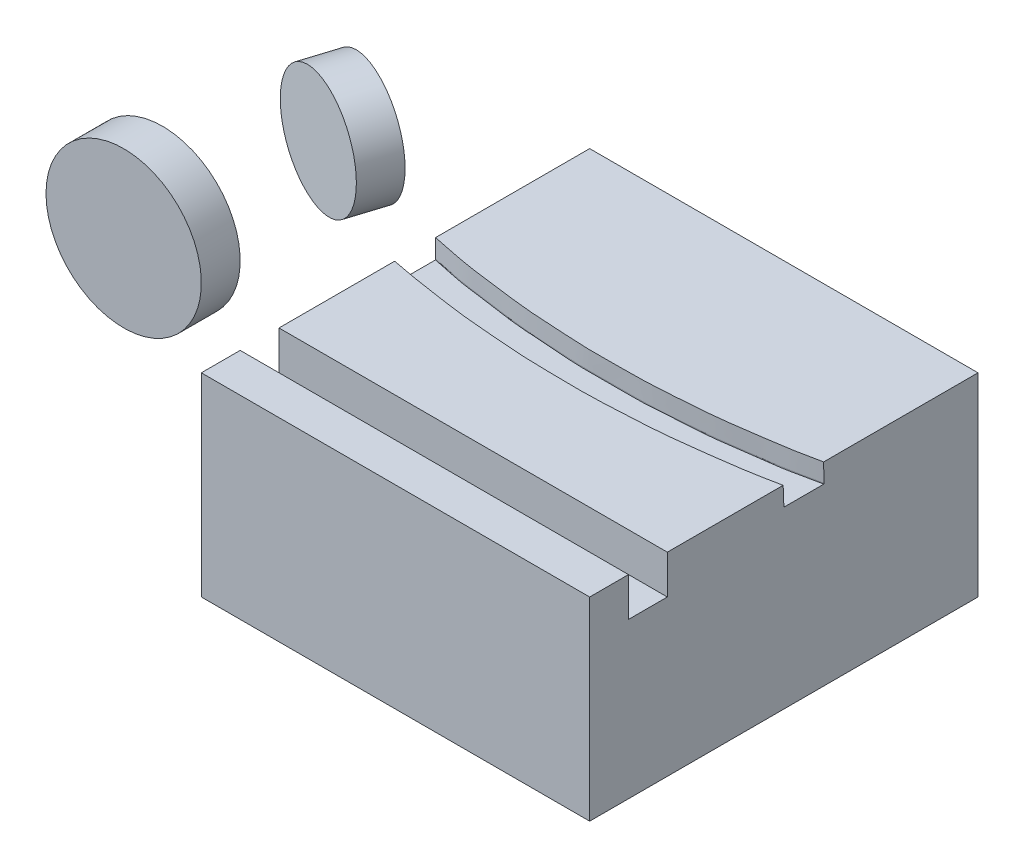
ISO-10303-21;
HEADER;
FILE_DESCRIPTION(('STEP AP214'),'2;1');
FILE_NAME('part.step','',(''),(''),'','','');
FILE_SCHEMA(('AUTOMOTIVE_DESIGN { 1 0 10303 214 1 1 1 1 }'));
ENDSEC;
DATA;
#1=APPLICATION_CONTEXT('core data for automotive mechanical design processes');
#2=APPLICATION_PROTOCOL_DEFINITION('international standard','automotive_design',2000,#1);
#3=PRODUCT_CONTEXT('',#1,'mechanical');
#4=PRODUCT('Part','Part','',(#3));
#5=PRODUCT_RELATED_PRODUCT_CATEGORY('part','',(#4));
#6=PRODUCT_DEFINITION_FORMATION('','',#4);
#7=PRODUCT_DEFINITION_CONTEXT('part definition',#1,'design');
#8=PRODUCT_DEFINITION('design','',#6,#7);
#9=PRODUCT_DEFINITION_SHAPE('','',#8);
#10=(LENGTH_UNIT() NAMED_UNIT(*) SI_UNIT(.MILLI.,.METRE.));
#11=(NAMED_UNIT(*) PLANE_ANGLE_UNIT() SI_UNIT($,.RADIAN.));
#12=(NAMED_UNIT(*) SI_UNIT($,.STERADIAN.) SOLID_ANGLE_UNIT());
#13=UNCERTAINTY_MEASURE_WITH_UNIT(LENGTH_MEASURE(1.E-05),#10,'distance_accuracy_value','');
#14=(GEOMETRIC_REPRESENTATION_CONTEXT(3) GLOBAL_UNCERTAINTY_ASSIGNED_CONTEXT((#13)) GLOBAL_UNIT_ASSIGNED_CONTEXT((#10,
#11,#12)) REPRESENTATION_CONTEXT('',''));
#15=CARTESIAN_POINT('',(0.,0.,0.));
#16=DIRECTION('',(0.,0.,1.));
#17=DIRECTION('',(1.,0.,0.));
#18=AXIS2_PLACEMENT_3D('',#15,#16,#17);
#19=CARTESIAN_POINT('',(-30.,10.,90.));
#20=DIRECTION('',(0.,0.,1.));
#21=DIRECTION('',(1.,0.,0.));
#22=AXIS2_PLACEMENT_3D('',#19,#20,#21);
#23=PLANE('',#22);
#24=CARTESIAN_POINT('',(-30.,10.,90.));
#25=DIRECTION('',(0.,0.,-1.));
#26=DIRECTION('',(-1.,0.,0.));
#27=AXIS2_PLACEMENT_3D('',#24,#25,#26);
#28=CIRCLE('',#27,20.);
#29=CARTESIAN_POINT('',(-50.,10.,90.));
#30=VERTEX_POINT('',#29);
#31=EDGE_CURVE('E14',#30,#30,#28,.T.);
#32=ORIENTED_EDGE('',*,*,#31,.F.);
#33=EDGE_LOOP('',(#32));
#34=FACE_BOUND('',#33,.T.);
#35=ADVANCED_FACE('F168',(#34),#23,.T.);
#36=CARTESIAN_POINT('',(-30.,10.,80.));
#37=DIRECTION('',(0.,0.,-1.));
#38=DIRECTION('',(-1.,0.,0.));
#39=AXIS2_PLACEMENT_3D('',#36,#37,#38);
#40=CYLINDRICAL_SURFACE('',#39,20.);
#41=ORIENTED_EDGE('',*,*,#31,.T.);
#42=EDGE_LOOP('',(#41));
#43=FACE_BOUND('',#42,.T.);
#44=CARTESIAN_POINT('',(-30.,10.,80.));
#45=DIRECTION('',(0.,0.,-1.));
#46=DIRECTION('',(-1.,0.,0.));
#47=AXIS2_PLACEMENT_3D('',#44,#45,#46);
#48=CIRCLE('',#47,20.);
#49=CARTESIAN_POINT('',(-50.,10.,80.));
#50=VERTEX_POINT('',#49);
#51=EDGE_CURVE('E174',#50,#50,#48,.T.);
#52=ORIENTED_EDGE('',*,*,#51,.F.);
#53=EDGE_LOOP('',(#52));
#54=FACE_BOUND('',#53,.T.);
#55=ADVANCED_FACE('F182',(#43,#54),#40,.T.);
#56=CARTESIAN_POINT('',(-30.,10.,80.));
#57=DIRECTION('',(0.,0.,-1.));
#58=DIRECTION('',(-1.,0.,0.));
#59=AXIS2_PLACEMENT_3D('',#56,#57,#58);
#60=PLANE('',#59);
#61=ORIENTED_EDGE('',*,*,#51,.T.);
#62=EDGE_LOOP('',(#61));
#63=FACE_BOUND('',#62,.T.);
#64=ADVANCED_FACE('F180',(#63),#60,.T.);
#65=CLOSED_SHELL('',(#35,#55,#64));
#66=MANIFOLD_SOLID_BREP('B2',#65);
#67=CARTESIAN_POINT('',(-26.679978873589,10.,43.1978224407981));
#68=DIRECTION('',(0.300705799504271,0.,-0.953716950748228));
#69=DIRECTION('',(-0.953716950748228,0.,-0.300705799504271));
#70=AXIS2_PLACEMENT_3D('',#67,#68,#69);
#71=PLANE('',#70);
#72=CARTESIAN_POINT('',(-26.679978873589,10.,43.1978224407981));
#73=DIRECTION('',(-0.300705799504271,0.,0.953716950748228));
#74=DIRECTION('',(0.953716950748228,0.,0.300705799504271));
#75=AXIS2_PLACEMENT_3D('',#72,#73,#74);
#76=CIRCLE('',#75,15.);
#77=CARTESIAN_POINT('',(-12.3742246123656,10.,47.7084094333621));
#78=VERTEX_POINT('',#77);
#79=EDGE_CURVE('E167',#78,#78,#76,.T.);
#80=ORIENTED_EDGE('',*,*,#79,.T.);
#81=EDGE_LOOP('',(#80));
#82=FACE_BOUND('',#81,.T.);
#83=ADVANCED_FACE('F220',(#82),#71,.F.);
#84=CARTESIAN_POINT('',(-25.1764498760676,10.,38.4292376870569));
#85=DIRECTION('',(-0.300705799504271,0.,0.953716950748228));
#86=DIRECTION('',(0.953716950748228,0.,0.300705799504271));
#87=AXIS2_PLACEMENT_3D('',#84,#85,#86);
#88=CYLINDRICAL_SURFACE('',#87,15.);
#89=ORIENTED_EDGE('',*,*,#79,.F.);
#90=EDGE_LOOP('',(#89));
#91=FACE_BOUND('',#90,.T.);
#92=CARTESIAN_POINT('',(-23.6729208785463,10.,33.6606529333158));
#93=DIRECTION('',(-0.300705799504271,0.,0.953716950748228));
#94=DIRECTION('',(0.953716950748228,0.,0.300705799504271));
#95=AXIS2_PLACEMENT_3D('',#92,#93,#94);
#96=CIRCLE('',#95,15.);
#97=CARTESIAN_POINT('',(-9.36716661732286,10.,38.1712399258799));
#98=VERTEX_POINT('',#97);
#99=EDGE_CURVE('E226',#98,#98,#96,.T.);
#100=ORIENTED_EDGE('',*,*,#99,.T.);
#101=EDGE_LOOP('',(#100));
#102=FACE_BOUND('',#101,.T.);
#103=ADVANCED_FACE('F232',(#91,#102),#88,.T.);
#104=CARTESIAN_POINT('',(-23.6729208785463,10.,33.6606529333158));
#105=DIRECTION('',(-0.300705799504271,0.,0.953716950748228));
#106=DIRECTION('',(0.953716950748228,0.,0.300705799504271));
#107=AXIS2_PLACEMENT_3D('',#104,#105,#106);
#108=PLANE('',#107);
#109=ORIENTED_EDGE('',*,*,#99,.F.);
#110=EDGE_LOOP('',(#109));
#111=FACE_BOUND('',#110,.T.);
#112=ADVANCED_FACE('F234',(#111),#108,.F.);
#113=CLOSED_SHELL('',(#83,#103,#112));
#114=MANIFOLD_SOLID_BREP('B9',#113);
#115=CARTESIAN_POINT('',(0.,0.,100.));
#116=DIRECTION('',(0.,-1.,0.));
#117=DIRECTION('',(0.,0.,-1.));
#118=AXIS2_PLACEMENT_3D('',#115,#116,#117);
#119=PLANE('',#118);
#120=DIRECTION('',(0.,0.,-1.));
#121=VECTOR('',#120,1.);
#122=CARTESIAN_POINT('',(100.,0.,100.));
#123=LINE('',#122,#121);
#124=CARTESIAN_POINT('',(100.,0.,100.));
#125=VERTEX_POINT('',#124);
#126=CARTESIAN_POINT('',(100.,0.,90.));
#127=VERTEX_POINT('',#126);
#128=EDGE_CURVE('E557',#125,#127,#123,.T.);
#129=ORIENTED_EDGE('',*,*,#128,.T.);
#130=DIRECTION('',(-1.,0.,0.));
#131=VECTOR('',#130,1.);
#132=CARTESIAN_POINT('',(0.,0.,90.));
#133=LINE('',#132,#131);
#134=CARTESIAN_POINT('',(0.,0.,90.));
#135=VERTEX_POINT('',#134);
#136=EDGE_CURVE('E270',#127,#135,#133,.T.);
#137=ORIENTED_EDGE('',*,*,#136,.T.);
#138=DIRECTION('',(0.,0.,-1.));
#139=VECTOR('',#138,1.);
#140=CARTESIAN_POINT('',(0.,0.,100.));
#141=LINE('',#140,#139);
#142=CARTESIAN_POINT('',(0.,0.,100.));
#143=VERTEX_POINT('',#142);
#144=EDGE_CURVE('E552',#143,#135,#141,.T.);
#145=ORIENTED_EDGE('',*,*,#144,.F.);
#146=DIRECTION('',(-1.,0.,0.));
#147=VECTOR('',#146,1.);
#148=CARTESIAN_POINT('',(0.,0.,100.));
#149=LINE('',#148,#147);
#150=EDGE_CURVE('E543',#125,#143,#149,.T.);
#151=ORIENTED_EDGE('',*,*,#150,.F.);
#152=EDGE_LOOP('',(#129,#137,#145,#151));
#153=FACE_BOUND('',#152,.T.);
#154=ADVANCED_FACE('F262',(#153),#119,.F.);
#155=CARTESIAN_POINT('',(0.,0.,100.));
#156=DIRECTION('',(1.,0.,0.));
#157=DIRECTION('',(0.,1.,0.));
#158=AXIS2_PLACEMENT_3D('',#155,#156,#157);
#159=PLANE('',#158);
#160=ORIENTED_EDGE('',*,*,#144,.T.);
#161=DIRECTION('',(0.,-1.,0.));
#162=VECTOR('',#161,1.);
#163=CARTESIAN_POINT('',(0.,0.,90.));
#164=LINE('',#163,#162);
#165=CARTESIAN_POINT('',(0.,-10.,90.));
#166=VERTEX_POINT('',#165);
#167=EDGE_CURVE('E375',#135,#166,#164,.T.);
#168=ORIENTED_EDGE('',*,*,#167,.T.);
#169=DIRECTION('',(0.,0.,-1.));
#170=VECTOR('',#169,1.);
#171=CARTESIAN_POINT('',(0.,-10.,100.));
#172=LINE('',#171,#170);
#173=CARTESIAN_POINT('',(0.,-10.,80.));
#174=VERTEX_POINT('',#173);
#175=EDGE_CURVE('E369',#166,#174,#172,.T.);
#176=ORIENTED_EDGE('',*,*,#175,.T.);
#177=DIRECTION('',(0.,1.,0.));
#178=VECTOR('',#177,1.);
#179=CARTESIAN_POINT('',(0.,0.,80.));
#180=LINE('',#179,#178);
#181=CARTESIAN_POINT('',(0.,0.,80.));
#182=VERTEX_POINT('',#181);
#183=EDGE_CURVE('E356',#174,#182,#180,.T.);
#184=ORIENTED_EDGE('',*,*,#183,.T.);
#185=CARTESIAN_POINT('',(0.,0.,50.2216369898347));
#186=VERTEX_POINT('',#185);
#187=EDGE_CURVE('E555',#182,#186,#141,.T.);
#188=ORIENTED_EDGE('',*,*,#187,.T.);
#189=CARTESIAN_POINT('',(-6.19384013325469E-10,-4.97800111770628,49.9182658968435));
#190=CARTESIAN_POINT('',(-2.22382007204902E-10,-4.94405701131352,49.9267186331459));
#191=CARTESIAN_POINT('',(-5.95769292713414E-11,-4.91011089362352,49.9351713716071));
#192=CARTESIAN_POINT('',(5.96022513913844E-11,-4.84214033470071,49.9518150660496));
#193=CARTESIAN_POINT('',(1.58927266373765E-11,-4.8081158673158,49.9600059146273));
#194=CARTESIAN_POINT('',(-1.57258612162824E-11,-4.74029710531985,49.9757741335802));
#195=CARTESIAN_POINT('',(-4.21196469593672E-12,-4.70650410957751,49.9833570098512));
#196=CARTESIAN_POINT('',(4.21254452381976E-12,-4.63875363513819,49.9977338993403));
#197=CARTESIAN_POINT('',(1.12511439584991E-12,-4.60479617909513,50.0045280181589));
#198=CARTESIAN_POINT('',(-1.1153384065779E-12,-4.53694569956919,50.0170135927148));
#199=CARTESIAN_POINT('',(-2.98464013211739E-13,-4.5030541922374,50.022713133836));
#200=CARTESIAN_POINT('',(2.99554063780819E-13,-4.43507177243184,50.0327704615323));
#201=CARTESIAN_POINT('',(0.,-4.40098086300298,50.0371282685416));
#202=CARTESIAN_POINT('',(0.,-4.33273177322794,50.0445831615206));
#203=CARTESIAN_POINT('',(0.,-4.29857385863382,50.0476827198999));
#204=CARTESIAN_POINT('',(0.,-4.23017555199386,50.0527859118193));
#205=CARTESIAN_POINT('',(0.,-4.19593515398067,50.0547894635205));
#206=CARTESIAN_POINT('',(0.,-4.09298641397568,50.0593765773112));
#207=CARTESIAN_POINT('',(0.,-4.02421408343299,50.0605201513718));
#208=CARTESIAN_POINT('',(0.,-3.88654313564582,50.060150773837));
#209=CARTESIAN_POINT('',(0.,-3.81764458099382,50.0586318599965));
#210=CARTESIAN_POINT('',(0.,-3.67977384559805,50.0540742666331));
#211=CARTESIAN_POINT('',(0.,-3.61080177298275,50.0510327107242));
#212=CARTESIAN_POINT('',(0.,-3.47284662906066,50.0445496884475));
#213=CARTESIAN_POINT('',(0.,-3.40386356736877,50.0411080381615));
#214=CARTESIAN_POINT('',(0.,-3.30012748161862,50.0364662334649));
#215=CARTESIAN_POINT('',(0.,-3.26538711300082,50.0350016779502));
#216=CARTESIAN_POINT('',(0.,-3.19589431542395,50.0323982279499));
#217=CARTESIAN_POINT('',(0.,-3.16114188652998,50.0312593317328));
#218=CARTESIAN_POINT('',(0.,-3.05694399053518,50.0283346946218));
#219=CARTESIAN_POINT('',(0.,-2.98748423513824,50.0270375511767));
#220=CARTESIAN_POINT('',(0.,-2.84858995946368,50.0257180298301));
#221=CARTESIAN_POINT('',(0.,-2.77915544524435,50.0256949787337));
#222=CARTESIAN_POINT('',(0.,-2.64029819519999,50.0268938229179));
#223=CARTESIAN_POINT('',(0.,-2.57087545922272,50.0281157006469));
#224=CARTESIAN_POINT('',(0.,-2.43206005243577,50.0317730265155));
#225=CARTESIAN_POINT('',(0.,-2.36266738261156,50.0342085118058));
#226=CARTESIAN_POINT('',(0.,-2.22390849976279,50.0402610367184));
#227=CARTESIAN_POINT('',(0.,-2.15454230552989,50.0438785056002));
#228=CARTESIAN_POINT('',(0.,-2.01586942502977,50.0522603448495));
#229=CARTESIAN_POINT('',(0.,-1.94656274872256,50.0570248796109));
#230=CARTESIAN_POINT('',(0.,-1.80804197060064,50.0676636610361));
#231=CARTESIAN_POINT('',(0.,-1.7388278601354,50.0735377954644));
#232=CARTESIAN_POINT('',(0.,-1.60016004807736,50.0863895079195));
#233=CARTESIAN_POINT('',(0.,-1.53070683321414,50.0933723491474));
#234=CARTESIAN_POINT('',(0.,-1.3919226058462,50.1083817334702));
#235=CARTESIAN_POINT('',(0.,-1.32259158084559,50.1164081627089));
#236=CARTESIAN_POINT('',(0.,-1.18398357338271,50.1328284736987));
#237=CARTESIAN_POINT('',(0.,-1.11470658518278,50.14122230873));
#238=CARTESIAN_POINT('',(0.,-0.976135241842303,50.157704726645));
#239=CARTESIAN_POINT('',(0.,-0.906840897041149,50.1657933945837));
#240=CARTESIAN_POINT('',(0.,-0.768029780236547,50.1810056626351));
#241=CARTESIAN_POINT('',(0.,-0.698512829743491,50.1881276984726));
#242=CARTESIAN_POINT('',(0.,-0.594123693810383,50.1975568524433));
#243=CARTESIAN_POINT('',(0.,-0.559308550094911,50.2004909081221));
#244=CARTESIAN_POINT('',(0.,-0.489639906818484,50.2058531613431));
#245=CARTESIAN_POINT('',(0.,-0.454786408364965,50.2082813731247));
#246=CARTESIAN_POINT('',(0.,-0.385009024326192,50.2125452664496));
#247=CARTESIAN_POINT('',(0.,-0.350085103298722,50.2143803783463));
#248=CARTESIAN_POINT('',(0.,-0.280206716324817,50.217366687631));
#249=CARTESIAN_POINT('',(0.,-0.245252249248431,50.2185178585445));
#250=CARTESIAN_POINT('',(0.,-0.175249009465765,50.2202536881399));
#251=CARTESIAN_POINT('',(0.,-0.140200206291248,50.2208370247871));
#252=CARTESIAN_POINT('',(0.,-0.0701003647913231,50.2215489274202));
#253=CARTESIAN_POINT('',(0.,-0.0350493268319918,50.2216775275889));
#254=CARTESIAN_POINT('',(0.,0.,50.2216369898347));
#255=B_SPLINE_CURVE_WITH_KNOTS('',3,(#189,#190,#191,#192,#193,#194,#195,#196,#197,#198,#199,
#200,#201,#202,#203,#204,#205,#206,#207,#208,#209,#210,#211,#212,#213,#214,#215,#216,#217,#218,
#219,#220,#221,#222,#223,#224,#225,#226,#227,#228,#229,#230,#231,#232,#233,#234,#235,#236,#237,
#238,#239,#240,#241,#242,#243,#244,#245,#246,#247,#248,#249,#250,#251,#252,#253,#254),
.UNSPECIFIED.,.F.,.F.,(4,2,2,2,2,2,2,2,2,2,2,2,2,2,2,2,2,2,2,2,2,2,2,2,2,2,2,2,2,2,2,2,4),(0.,
0.104945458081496,0.209933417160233,0.313826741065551,0.417706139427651,0.520785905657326,
0.623864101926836,0.726738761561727,0.829621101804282,1.03587814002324,1.24259765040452,
1.44970915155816,1.6569162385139,1.76122868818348,1.86554058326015,2.07394312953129,
2.28223556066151,2.49052505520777,2.69882092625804,2.90719252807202,3.11559401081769,
3.32397442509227,3.53337537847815,3.74275350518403,3.95210508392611,4.16139787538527,
4.37102542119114,4.47583807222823,4.58064777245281,4.68555784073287,4.79047196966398,
4.8956297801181,5.00077968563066),.UNSPECIFIED.);
#256=CARTESIAN_POINT('',(0.,-4.97800111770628,49.9182658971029));
#257=VERTEX_POINT('',#256);
#258=EDGE_CURVE('E437',#257,#186,#255,.T.);
#259=ORIENTED_EDGE('',*,*,#258,.F.);
#260=CARTESIAN_POINT('',(-7.51408688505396E-11,-4.97800108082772,39.7071429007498));
#261=CARTESIAN_POINT('',(-2.08725047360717E-11,-4.97800108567,41.4089967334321));
#262=CARTESIAN_POINT('',(-4.17440939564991E-12,-4.97800109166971,43.1108505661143));
#263=CARTESIAN_POINT('',(2.08775392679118E-12,-4.97800110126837,45.6636313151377));
#264=CARTESIAN_POINT('',(1.04431175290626E-12,-4.97800110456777,46.5145582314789));
#265=CARTESIAN_POINT('',(-1.0424952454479E-12,-4.97800111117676,48.2164120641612));
#266=CARTESIAN_POINT('',(-2.08586006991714E-12,-4.97800111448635,49.0673389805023));
#267=CARTESIAN_POINT('',(0.,-4.97800111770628,49.9182658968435));
#268=B_SPLINE_CURVE_WITH_KNOTS('',3,(#260,#261,#262,#263,#264,#265,#266,#267),.UNSPECIFIED.,.F.,
.F.,(4,2,2,4),(0.,5.10556149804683,7.65834224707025,10.2111229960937),.UNSPECIFIED.);
#269=CARTESIAN_POINT('',(-3.98699248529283E-09,-4.97800108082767,39.7071428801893));
#270=VERTEX_POINT('',#269);
#271=EDGE_CURVE('E508',#270,#257,#268,.T.);
#272=ORIENTED_EDGE('',*,*,#271,.F.);
#273=CARTESIAN_POINT('',(0.,-4.81204570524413,39.6667976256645));
#274=CARTESIAN_POINT('',(0.,-4.83130939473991,39.6714764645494));
#275=CARTESIAN_POINT('',(0.,-4.85057273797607,39.6761567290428));
#276=CARTESIAN_POINT('',(0.,-4.88786389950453,39.6852199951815));
#277=CARTESIAN_POINT('',(0.,-4.90589176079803,39.6896028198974));
#278=CARTESIAN_POINT('',(0.,-4.94194687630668,39.6983709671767));
#279=CARTESIAN_POINT('',(0.,-4.95997413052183,39.7027562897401));
#280=CARTESIAN_POINT('',(0.,-4.97800108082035,39.7071428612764));
#281=B_SPLINE_CURVE_WITH_KNOTS('',3,(#273,#274,#275,#276,#277,#278,#279,#280),.UNSPECIFIED.,.F.,
.F.,(4,2,2,4),(0.,0.0594712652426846,0.115130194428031,0.1707891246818),.UNSPECIFIED.);
#282=CARTESIAN_POINT('',(-8.70588101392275E-09,-4.81204570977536,39.6667975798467));
#283=VERTEX_POINT('',#282);
#284=EDGE_CURVE('E515',#283,#270,#281,.T.);
#285=ORIENTED_EDGE('',*,*,#284,.F.);
#286=CARTESIAN_POINT('',(0.,0.,39.6818818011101));
#287=CARTESIAN_POINT('',(0.,-0.432532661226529,39.6805256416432));
#288=CARTESIAN_POINT('',(0.,-0.865065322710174,39.6791695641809));
#289=CARTESIAN_POINT('',(0.,-1.73013064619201,39.6764575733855));
#290=CARTESIAN_POINT('',(0.,-2.1626633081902,39.6751016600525));
#291=CARTESIAN_POINT('',(0.,-3.33414588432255,39.6714294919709));
#292=CARTESIAN_POINT('',(0.,-4.07309579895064,39.6691133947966));
#293=CARTESIAN_POINT('',(0.,-4.8120457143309,39.6667975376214));
#294=B_SPLINE_CURVE_WITH_KNOTS('',3,(#286,#287,#288,#289,#290,#291,#292,#293),.UNSPECIFIED.,.F.,
.F.,(4,2,2,4),(0.,1.29760436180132,2.59520872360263,4.81206935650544),.UNSPECIFIED.);
#295=CARTESIAN_POINT('',(0.,0.,39.6818818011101));
#296=VERTEX_POINT('',#295);
#297=EDGE_CURVE('E499',#296,#283,#294,.T.);
#298=ORIENTED_EDGE('',*,*,#297,.F.);
#299=CARTESIAN_POINT('',(0.,0.,0.));
#300=VERTEX_POINT('',#299);
#301=EDGE_CURVE('E556',#296,#300,#141,.T.);
#302=ORIENTED_EDGE('',*,*,#301,.T.);
#303=DIRECTION('',(0.,-1.,0.));
#304=VECTOR('',#303,1.);
#305=CARTESIAN_POINT('',(0.,0.,0.));
#306=LINE('',#305,#304);
#307=CARTESIAN_POINT('',(0.,-50.,0.));
#308=VERTEX_POINT('',#307);
#309=EDGE_CURVE('E534',#300,#308,#306,.T.);
#310=ORIENTED_EDGE('',*,*,#309,.T.);
#311=DIRECTION('',(0.,0.,-1.));
#312=VECTOR('',#311,1.);
#313=CARTESIAN_POINT('',(0.,-50.,100.));
#314=LINE('',#313,#312);
#315=CARTESIAN_POINT('',(0.,-50.,100.));
#316=VERTEX_POINT('',#315);
#317=EDGE_CURVE('E564',#316,#308,#314,.T.);
#318=ORIENTED_EDGE('',*,*,#317,.F.);
#319=DIRECTION('',(0.,-1.,0.));
#320=VECTOR('',#319,1.);
#321=CARTESIAN_POINT('',(0.,0.,100.));
#322=LINE('',#321,#320);
#323=EDGE_CURVE('E551',#143,#316,#322,.T.);
#324=ORIENTED_EDGE('',*,*,#323,.F.);
#325=EDGE_LOOP('',(#160,#168,#176,#184,#188,#259,#272,#285,#298,#302,#310,#318,#324));
#326=FACE_BOUND('',#325,.T.);
#327=ADVANCED_FACE('F264',(#326),#159,.F.);
#328=CARTESIAN_POINT('',(100.,0.,100.));
#329=DIRECTION('',(-1.,0.,0.));
#330=DIRECTION('',(0.,0.,1.));
#331=AXIS2_PLACEMENT_3D('',#328,#329,#330);
#332=PLANE('',#331);
#333=DIRECTION('',(0.,0.,1.));
#334=VECTOR('',#333,1.);
#335=CARTESIAN_POINT('',(100.,-10.,100.));
#336=LINE('',#335,#334);
#337=CARTESIAN_POINT('',(100.,-10.,80.));
#338=VERTEX_POINT('',#337);
#339=CARTESIAN_POINT('',(100.,-10.,90.));
#340=VERTEX_POINT('',#339);
#341=EDGE_CURVE('E218',#338,#340,#336,.T.);
#342=ORIENTED_EDGE('',*,*,#341,.T.);
#343=DIRECTION('',(0.,1.,0.));
#344=VECTOR('',#343,1.);
#345=CARTESIAN_POINT('',(100.,0.,90.));
#346=LINE('',#345,#344);
#347=EDGE_CURVE('E364',#340,#127,#346,.T.);
#348=ORIENTED_EDGE('',*,*,#347,.T.);
#349=ORIENTED_EDGE('',*,*,#128,.F.);
#350=DIRECTION('',(0.,1.,0.));
#351=VECTOR('',#350,1.);
#352=CARTESIAN_POINT('',(100.,0.,100.));
#353=LINE('',#352,#351);
#354=CARTESIAN_POINT('',(100.,-50.,100.));
#355=VERTEX_POINT('',#354);
#356=EDGE_CURVE('E579',#355,#125,#353,.T.);
#357=ORIENTED_EDGE('',*,*,#356,.F.);
#358=DIRECTION('',(0.,0.,-1.));
#359=VECTOR('',#358,1.);
#360=CARTESIAN_POINT('',(100.,-50.,100.));
#361=LINE('',#360,#359);
#362=CARTESIAN_POINT('',(100.,-50.,0.));
#363=VERTEX_POINT('',#362);
#364=EDGE_CURVE('E560',#355,#363,#361,.T.);
#365=ORIENTED_EDGE('',*,*,#364,.T.);
#366=DIRECTION('',(0.,1.,0.));
#367=VECTOR('',#366,1.);
#368=CARTESIAN_POINT('',(100.,0.,0.));
#369=LINE('',#368,#367);
#370=CARTESIAN_POINT('',(100.,0.,0.));
#371=VERTEX_POINT('',#370);
#372=EDGE_CURVE('E540',#363,#371,#369,.T.);
#373=ORIENTED_EDGE('',*,*,#372,.T.);
#374=CARTESIAN_POINT('',(100.,0.,39.7483371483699));
#375=VERTEX_POINT('',#374);
#376=EDGE_CURVE('E554',#375,#371,#123,.T.);
#377=ORIENTED_EDGE('',*,*,#376,.F.);
#378=CARTESIAN_POINT('',(100.,-4.80685049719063,39.6700376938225));
#379=CARTESIAN_POINT('',(100.,-4.37437292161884,39.6770725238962));
#380=CARTESIAN_POINT('',(100.,-3.94189538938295,39.6841100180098));
#381=CARTESIAN_POINT('',(100.,-3.07694041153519,39.6981903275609));
#382=CARTESIAN_POINT('',(100.,-2.64446296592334,39.7052331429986));
#383=CARTESIAN_POINT('',(100.,-1.47465691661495,39.7242904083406));
#384=CARTESIAN_POINT('',(100.,-0.737328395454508,39.7363099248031));
#385=CARTESIAN_POINT('',(100.,0.,39.7483371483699));
#386=B_SPLINE_CURVE_WITH_KNOTS('',3,(#378,#379,#380,#381,#382,#383,#384,#385),.UNSPECIFIED.,.F.,
.F.,(4,2,2,4),(0.,1.29760436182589,2.59520872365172,4.80748817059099),.UNSPECIFIED.);
#387=CARTESIAN_POINT('',(99.9999999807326,-4.80685050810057,39.6700376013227));
#388=VERTEX_POINT('',#387);
#389=EDGE_CURVE('E285',#388,#375,#386,.T.);
#390=ORIENTED_EDGE('',*,*,#389,.F.);
#391=CARTESIAN_POINT('',(99.9999999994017,-4.9780011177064,39.6860662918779));
#392=CARTESIAN_POINT('',(99.9999999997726,-4.95826356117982,39.684219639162));
#393=CARTESIAN_POINT('',(99.9999999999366,-4.93852606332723,39.6823723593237));
#394=CARTESIAN_POINT('',(100.00000000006,-4.90013216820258,39.6787777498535));
#395=CARTESIAN_POINT('',(100.00000000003,-4.88147576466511,39.677030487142));
#396=CARTESIAN_POINT('',(99.9999999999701,-4.84416306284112,39.6735348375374));
#397=CARTESIAN_POINT('',(99.9999999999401,-4.8255067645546,39.6717864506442));
#398=CARTESIAN_POINT('',(100.,-4.80685051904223,39.6700375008));
#399=B_SPLINE_CURVE_WITH_KNOTS('',3,(#391,#392,#393,#394,#395,#396,#397,#398),.UNSPECIFIED.,.F.,
.F.,(4,2,2,4),(0.,0.0594712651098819,0.115685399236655,0.171899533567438),.UNSPECIFIED.);
#400=CARTESIAN_POINT('',(100.000000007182,-4.9780011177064,39.6860663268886));
#401=VERTEX_POINT('',#400);
#402=EDGE_CURVE('E461',#401,#388,#399,.T.);
#403=ORIENTED_EDGE('',*,*,#402,.F.);
#404=CARTESIAN_POINT('',(99.9999999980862,-4.97800111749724,49.8876930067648));
#405=CARTESIAN_POINT('',(99.9999999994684,-4.97800111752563,48.1874218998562));
#406=CARTESIAN_POINT('',(99.9999999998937,-4.97800111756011,46.4871507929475));
#407=CARTESIAN_POINT('',(100.000000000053,-4.97800111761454,43.9367441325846));
#408=CARTESIAN_POINT('',(100.000000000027,-4.97800111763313,43.0866085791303));
#409=CARTESIAN_POINT('',(99.9999999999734,-4.97800111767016,41.3863374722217));
#410=CARTESIAN_POINT('',(99.9999999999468,-4.97800111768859,40.5362019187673));
#411=CARTESIAN_POINT('',(100.,-4.9780011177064,39.686066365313));
#412=B_SPLINE_CURVE_WITH_KNOTS('',3,(#404,#405,#406,#407,#408,#409,#410,#411),.UNSPECIFIED.,.F.,
.F.,(4,2,2,4),(0.,5.10081332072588,7.65121998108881,10.2016266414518),.UNSPECIFIED.);
#413=CARTESIAN_POINT('',(100.,-4.97800111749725,49.8876930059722));
#414=VERTEX_POINT('',#413);
#415=EDGE_CURVE('E462',#414,#401,#412,.T.);
#416=ORIENTED_EDGE('',*,*,#415,.F.);
#417=CARTESIAN_POINT('',(100.,0.,50.1819206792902));
#418=CARTESIAN_POINT('',(100.,-0.0690921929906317,50.176852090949));
#419=CARTESIAN_POINT('',(100.,-0.138183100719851,50.1717663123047));
#420=CARTESIAN_POINT('',(100.,-0.276365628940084,50.1616020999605));
#421=CARTESIAN_POINT('',(100.,-0.345457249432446,50.1565236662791));
#422=CARTESIAN_POINT('',(100.,-0.552744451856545,50.1413615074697));
#423=CARTESIAN_POINT('',(100.,-0.690945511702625,50.1313514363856));
#424=CARTESIAN_POINT('',(100.,-0.967416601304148,50.112396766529));
#425=CARTESIAN_POINT('',(100.,-1.10568662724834,50.1034521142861));
#426=CARTESIAN_POINT('',(100.,-1.31317033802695,50.0914517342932));
#427=CARTESIAN_POINT('',(100.,-1.38234267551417,50.0876877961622));
#428=CARTESIAN_POINT('',(100.,-1.52071646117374,50.0807405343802));
#429=CARTESIAN_POINT('',(100.,-1.58991790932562,50.0775572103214));
#430=CARTESIAN_POINT('',(100.,-1.79756155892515,50.0688052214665));
#431=CARTESIAN_POINT('',(100.,-1.93603763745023,50.0640348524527));
#432=CARTESIAN_POINT('',(100.,-2.21306290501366,50.0562049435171));
#433=CARTESIAN_POINT('',(100.,-2.35161210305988,50.0531457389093));
#434=CARTESIAN_POINT('',(100.,-2.59424926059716,50.0489254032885));
#435=CARTESIAN_POINT('',(100.,-2.69833258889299,50.0474813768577));
#436=CARTESIAN_POINT('',(100.,-2.90649758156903,50.0451363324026));
#437=CARTESIAN_POINT('',(100.,-3.01057924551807,50.0442352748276));
#438=CARTESIAN_POINT('',(100.,-3.16667593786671,50.0431902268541));
#439=CARTESIAN_POINT('',(100.,-3.21869002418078,50.0428930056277));
#440=CARTESIAN_POINT('',(100.,-3.32271871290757,50.0423141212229));
#441=CARTESIAN_POINT('',(100.,-3.37473331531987,50.0420324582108));
#442=CARTESIAN_POINT('',(100.,-3.53067042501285,50.040814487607));
#443=CARTESIAN_POINT('',(100.,-3.63459145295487,50.0395053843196));
#444=CARTESIAN_POINT('',(100.,-3.84239457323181,50.0339742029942));
#445=CARTESIAN_POINT('',(100.,-3.94627665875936,50.0297517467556));
#446=CARTESIAN_POINT('',(100.,-4.1018620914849,50.0197828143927));
#447=CARTESIAN_POINT('',(100.,-4.15368027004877,50.0158544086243));
#448=CARTESIAN_POINT('',(100.,-4.2571812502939,50.0065498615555));
#449=CARTESIAN_POINT('',(100.,-4.30886407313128,50.0011739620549));
#450=CARTESIAN_POINT('',(100.,-4.38630946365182,49.9918479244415));
#451=CARTESIAN_POINT('',(100.,-4.41214805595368,49.9885232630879));
#452=CARTESIAN_POINT('',(100.,-4.46376300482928,49.9814213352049));
#453=CARTESIAN_POINT('',(100.,-4.48953936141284,49.9776440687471));
#454=CARTESIAN_POINT('',(100.,-4.56678936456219,49.9657217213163));
#455=CARTESIAN_POINT('',(100.,-4.61817190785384,49.9569875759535));
#456=CARTESIAN_POINT('',(100.,-4.72103094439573,49.9384305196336));
#457=CARTESIAN_POINT('',(100.,-4.77250635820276,49.9286017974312));
#458=CARTESIAN_POINT('',(99.9999999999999,-4.87532369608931,49.9084161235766));
#459=CARTESIAN_POINT('',(99.9999999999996,-4.92666567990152,49.8980594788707));
#460=CARTESIAN_POINT('',(99.999999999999,-4.97800111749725,49.8876930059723));
#461=B_SPLINE_CURVE_WITH_KNOTS('',3,(#417,#418,#419,#420,#421,#422,#423,#424,#425,#426,#427,
#428,#429,#430,#431,#432,#433,#434,#435,#436,#437,#438,#439,#440,#441,#442,#443,#444,#445,#446,
#447,#448,#449,#450,#451,#452,#453,#454,#455,#456,#457,#458,#459,#460),.UNSPECIFIED.,.F.,.F.,(4,
2,2,2,2,2,2,2,2,2,2,2,2,2,2,2,2,2,2,2,2,4),(0.,0.207833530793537,0.41566757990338,
0.831356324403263,1.24702419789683,1.45484605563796,1.66266776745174,2.07832750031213,
2.49406865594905,2.80634698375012,3.11860256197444,3.2746472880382,3.43069368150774,
3.74247081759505,4.05428843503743,4.21017302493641,4.36603159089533,4.44418294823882,
4.52233429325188,4.67867334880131,4.83588601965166,4.99300830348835),.UNSPECIFIED.);
#462=CARTESIAN_POINT('',(100.,0.,50.1819206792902));
#463=VERTEX_POINT('',#462);
#464=EDGE_CURVE('E436',#463,#414,#461,.T.);
#465=ORIENTED_EDGE('',*,*,#464,.F.);
#466=CARTESIAN_POINT('',(100.,0.,80.));
#467=VERTEX_POINT('',#466);
#468=EDGE_CURVE('E561',#467,#463,#123,.T.);
#469=ORIENTED_EDGE('',*,*,#468,.F.);
#470=DIRECTION('',(0.,-1.,0.));
#471=VECTOR('',#470,1.);
#472=CARTESIAN_POINT('',(100.,0.,80.));
#473=LINE('',#472,#471);
#474=EDGE_CURVE('E277',#467,#338,#473,.T.);
#475=ORIENTED_EDGE('',*,*,#474,.T.);
#476=EDGE_LOOP('',(#342,#348,#349,#357,#365,#373,#377,#390,#403,#416,#465,#469,#475));
#477=FACE_BOUND('',#476,.T.);
#478=ADVANCED_FACE('F596',(#477),#332,.F.);
#479=ORIENTED_EDGE('',*,*,#187,.F.);
#480=DIRECTION('',(1.,0.,0.));
#481=VECTOR('',#480,1.);
#482=CARTESIAN_POINT('',(0.,0.,80.));
#483=LINE('',#482,#481);
#484=EDGE_CURVE('E360',#182,#467,#483,.T.);
#485=ORIENTED_EDGE('',*,*,#484,.T.);
#486=ORIENTED_EDGE('',*,*,#468,.T.);
#487=CARTESIAN_POINT('',(0.,0.,50.2216369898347));
#488=CARTESIAN_POINT('',(0.353378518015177,0.,50.2948206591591));
#489=CARTESIAN_POINT('',(0.706967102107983,0.,50.3669997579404));
#490=CARTESIAN_POINT('',(1.41454149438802,0.,50.5090246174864));
#491=CARTESIAN_POINT('',(1.76852721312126,0.,50.5788708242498));
#492=CARTESIAN_POINT('',(2.47697227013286,0.,50.7159270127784));
#493=CARTESIAN_POINT('',(2.83143155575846,0.,50.7831372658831));
#494=CARTESIAN_POINT('',(3.36358304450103,0.,50.8817624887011));
#495=CARTESIAN_POINT('',(3.54107181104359,0.,50.9142774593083));
#496=CARTESIAN_POINT('',(3.89619042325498,0.,50.9785275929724));
#497=CARTESIAN_POINT('',(4.07382026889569,0.,51.0102627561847));
#498=CARTESIAN_POINT('',(4.6069204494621,0.,51.1043807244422));
#499=CARTESIAN_POINT('',(4.96258357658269,0.,51.1656727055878));
#500=CARTESIAN_POINT('',(5.67434549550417,0.,51.2858839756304));
#501=CARTESIAN_POINT('',(6.03044432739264,0.,51.3448030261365));
#502=CARTESIAN_POINT('',(6.86211208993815,0.,51.4801612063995));
#503=CARTESIAN_POINT('',(7.33779985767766,0.,51.5558683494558));
#504=CARTESIAN_POINT('',(8.28948902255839,0.,51.7052991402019));
#505=CARTESIAN_POINT('',(8.76549042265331,0.,51.7790227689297));
#506=CARTESIAN_POINT('',(9.47955979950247,0.,51.8891748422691));
#507=CARTESIAN_POINT('',(9.71759450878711,0.,51.9258200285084));
#508=CARTESIAN_POINT('',(10.1936549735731,0.,51.9991684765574));
#509=CARTESIAN_POINT('',(10.4316807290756,0.,52.0358717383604));
#510=CARTESIAN_POINT('',(10.907724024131,0.,52.1093299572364));
#511=CARTESIAN_POINT('',(11.1457415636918,0.,52.1460849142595));
#512=CARTESIAN_POINT('',(11.6217876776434,0.,52.2195233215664));
#513=CARTESIAN_POINT('',(11.859816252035,0.,52.256206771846));
#514=CARTESIAN_POINT('',(12.5739386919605,0.,52.3660055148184));
#515=CARTESIAN_POINT('',(13.050071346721,0.,52.4388695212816));
#516=CARTESIAN_POINT('',(14.0025688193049,0.,52.5831122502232));
#517=CARTESIAN_POINT('',(14.4789336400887,0.,52.6544909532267));
#518=CARTESIAN_POINT('',(15.4318692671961,0.,52.7949293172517));
#519=CARTESIAN_POINT('',(15.908439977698,0.,52.8639896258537));
#520=CARTESIAN_POINT('',(16.8620210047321,0.,52.9989945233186));
#521=CARTESIAN_POINT('',(17.3390313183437,0.,53.064939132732));
#522=CARTESIAN_POINT('',(18.293570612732,0.,53.1928923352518));
#523=CARTESIAN_POINT('',(18.7710995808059,0.,53.2549010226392));
#524=CARTESIAN_POINT('',(19.6072978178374,0.,53.3592502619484));
#525=CARTESIAN_POINT('',(19.9658368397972,0.,53.4026323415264));
#526=CARTESIAN_POINT('',(20.5039090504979,0.,53.4654417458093));
#527=CARTESIAN_POINT('',(20.6833104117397,0.,53.4860009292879));
#528=CARTESIAN_POINT('',(21.042203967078,0.,53.5263104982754));
#529=CARTESIAN_POINT('',(21.2216961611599,0.,53.5460608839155));
#530=CARTESIAN_POINT('',(21.7603008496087,0.,53.6041595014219));
#531=CARTESIAN_POINT('',(22.1195379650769,0.,53.6413547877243));
#532=CARTESIAN_POINT('',(22.8382640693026,0.,53.713223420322));
#533=CARTESIAN_POINT('',(23.1977530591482,0.,53.7478967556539));
#534=CARTESIAN_POINT('',(23.9169888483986,0.,53.8152513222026));
#535=CARTESIAN_POINT('',(24.2767356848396,0.,53.8479321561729));
#536=CARTESIAN_POINT('',(24.9963562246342,0.,53.9118520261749));
#537=CARTESIAN_POINT('',(25.3562299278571,0.,53.943091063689));
#538=CARTESIAN_POINT('',(26.0760509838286,0.,54.0047259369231));
#539=CARTESIAN_POINT('',(26.4359983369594,0.,54.0351217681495));
#540=CARTESIAN_POINT('',(27.1559097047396,0.,54.0957127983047));
#541=CARTESIAN_POINT('',(27.5158737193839,0.,54.1259079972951));
#542=CARTESIAN_POINT('',(28.2358226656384,0.,54.1865381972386));
#543=CARTESIAN_POINT('',(28.5958075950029,0.,54.2169732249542));
#544=CARTESIAN_POINT('',(29.3157939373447,0.,54.2776472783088));
#545=CARTESIAN_POINT('',(29.6757953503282,0.,54.3078863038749));
#546=CARTESIAN_POINT('',(30.7558594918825,0.,54.3978179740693));
#547=CARTESIAN_POINT('',(31.4759889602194,0.,54.4567258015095));
#548=CARTESIAN_POINT('',(32.7363826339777,0.,54.5555133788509));
#549=CARTESIAN_POINT('',(33.2765619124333,0.,54.5964659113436));
#550=CARTESIAN_POINT('',(34.3571268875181,0.,54.6744341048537));
#551=CARTESIAN_POINT('',(34.8975125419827,0.,54.7114503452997));
#552=CARTESIAN_POINT('',(35.9785306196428,0.,54.7803587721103));
#553=CARTESIAN_POINT('',(36.5191629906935,0.,54.8122517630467));
#554=CARTESIAN_POINT('',(37.3303340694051,0.,54.8553735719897));
#555=CARTESIAN_POINT('',(37.6007481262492,0.,54.8689606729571));
#556=CARTESIAN_POINT('',(38.1416580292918,0.,54.8943959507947));
#557=CARTESIAN_POINT('',(38.4121538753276,0.,54.9062441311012));
#558=CARTESIAN_POINT('',(38.9532071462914,0.,54.9281372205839));
#559=CARTESIAN_POINT('',(39.2237645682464,0.,54.9381822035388));
#560=CARTESIAN_POINT('',(39.7649322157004,0.,54.9567327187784));
#561=CARTESIAN_POINT('',(40.0355424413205,0.,54.965238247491));
#562=CARTESIAN_POINT('',(40.8475009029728,0.,54.9887719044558));
#563=CARTESIAN_POINT('',(41.3889065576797,0.,55.0018143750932));
#564=CARTESIAN_POINT('',(42.4718500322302,0.,55.0244374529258));
#565=CARTESIAN_POINT('',(43.0133878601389,0.,55.0340176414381));
#566=CARTESIAN_POINT('',(44.0965069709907,0.,55.0517457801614));
#567=CARTESIAN_POINT('',(44.6380882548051,0.,55.0598936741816));
#568=CARTESIAN_POINT('',(45.9013652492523,0.,55.0796497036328));
#569=CARTESIAN_POINT('',(46.6230569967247,0.,55.0915073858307));
#570=CARTESIAN_POINT('',(48.0664063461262,0.,55.1134516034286));
#571=CARTESIAN_POINT('',(48.7880639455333,0.,55.123538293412));
#572=CARTESIAN_POINT('',(50.2314111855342,0.,55.1389527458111));
#573=CARTESIAN_POINT('',(50.9531008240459,0.,55.1442806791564));
#574=CARTESIAN_POINT('',(52.3965872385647,0.,55.1471953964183));
#575=CARTESIAN_POINT('',(53.1183840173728,0.,55.1447812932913));
#576=CARTESIAN_POINT('',(54.561890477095,0.,55.1292363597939));
#577=CARTESIAN_POINT('',(55.2836001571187,0.,55.1161054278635));
#578=CARTESIAN_POINT('',(56.7266339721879,0.,55.0760688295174));
#579=CARTESIAN_POINT('',(57.4479581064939,0.,55.0491631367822));
#580=CARTESIAN_POINT('',(58.7097310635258,0.,54.9943307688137));
#581=CARTESIAN_POINT('',(59.2502706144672,0.,54.9683445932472));
#582=CARTESIAN_POINT('',(60.0609785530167,0.,54.92724815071));
#583=CARTESIAN_POINT('',(60.3312008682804,0.,54.9131962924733));
#584=CARTESIAN_POINT('',(60.8716244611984,0.,54.8846912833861));
#585=CARTESIAN_POINT('',(61.141825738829,0.,54.8702381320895));
#586=CARTESIAN_POINT('',(61.6822338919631,0.,54.8412098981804));
#587=CARTESIAN_POINT('',(61.9524407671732,0.,54.8266348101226));
#588=CARTESIAN_POINT('',(62.4928661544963,0.,54.7977048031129));
#589=CARTESIAN_POINT('',(62.7630846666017,0.,54.7833498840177));
#590=CARTESIAN_POINT('',(63.3035457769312,0.,54.7548146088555));
#591=CARTESIAN_POINT('',(63.573788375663,0.,54.7406342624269));
#592=CARTESIAN_POINT('',(64.1142728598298,0.,54.7122586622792));
#593=CARTESIAN_POINT('',(64.3845147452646,0.,54.6980634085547));
#594=CARTESIAN_POINT('',(65.1952409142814,0.,54.6552220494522));
#595=CARTESIAN_POINT('',(65.7357119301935,0.,54.626321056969));
#596=CARTESIAN_POINT('',(66.8165220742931,0.,54.5665395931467));
#597=CARTESIAN_POINT('',(67.3568612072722,0.,54.5356592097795));
#598=CARTESIAN_POINT('',(68.4372924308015,0.,54.4706260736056));
#599=CARTESIAN_POINT('',(68.9773845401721,0.,54.4364736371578));
#600=CARTESIAN_POINT('',(70.0572084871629,0.,54.3636020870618));
#601=CARTESIAN_POINT('',(70.5969403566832,0.,54.3248834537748));
#602=CARTESIAN_POINT('',(71.4963498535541,0.,54.2554445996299));
#603=CARTESIAN_POINT('',(71.8561531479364,0.,54.2263525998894));
#604=CARTESIAN_POINT('',(72.5755057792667,0.,54.1651815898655));
#605=CARTESIAN_POINT('',(72.9350551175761,0.,54.1331025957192));
#606=CARTESIAN_POINT('',(73.4741571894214,0.,54.0824329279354));
#607=CARTESIAN_POINT('',(73.6538302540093,0.,54.0651168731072));
#608=CARTESIAN_POINT('',(74.0130926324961,0.,54.0296362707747));
#609=CARTESIAN_POINT('',(74.1926819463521,0.,54.0114717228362));
#610=CARTESIAN_POINT('',(74.7313337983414,0.,53.9558440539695));
#611=CARTESIAN_POINT('',(75.0902794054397,0.,53.9172469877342));
#612=CARTESIAN_POINT('',(76.166780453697,0.,53.7978083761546));
#613=CARTESIAN_POINT('',(76.883929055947,0.,53.7133263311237));
#614=CARTESIAN_POINT('',(77.9592136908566,0.,53.5832532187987));
#615=CARTESIAN_POINT('',(78.3175589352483,0.,53.5393384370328));
#616=CARTESIAN_POINT('',(79.0342039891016,0.,53.4511355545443));
#617=CARTESIAN_POINT('',(79.3925037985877,0.,53.4068474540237));
#618=CARTESIAN_POINT('',(80.1091086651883,0.,53.3184802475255));
#619=CARTESIAN_POINT('',(80.4674137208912,0.,53.2744011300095));
#620=CARTESIAN_POINT('',(81.1840084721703,0.,53.1861179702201));
#621=CARTESIAN_POINT('',(81.5422981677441,0.,53.1419139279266));
#622=CARTESIAN_POINT('',(82.6171043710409,0.,53.00874285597));
#623=CARTESIAN_POINT('',(83.3335524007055,0.,52.9192175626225));
#624=CARTESIAN_POINT('',(84.7183396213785,0.,52.742630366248));
#625=CARTESIAN_POINT('',(85.3867082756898,0.,52.6558008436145));
#626=CARTESIAN_POINT('',(86.7227908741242,0.,52.4772830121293));
#627=CARTESIAN_POINT('',(87.390504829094,0.,52.3855947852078));
#628=CARTESIAN_POINT('',(88.3913573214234,0.,52.2431313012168));
#629=CARTESIAN_POINT('',(88.7248472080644,0.,52.19482281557));
#630=CARTESIAN_POINT('',(89.391553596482,0.,52.0963540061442));
#631=CARTESIAN_POINT('',(89.7247700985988,0.,52.0461936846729));
#632=CARTESIAN_POINT('',(90.3908784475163,0.,51.9437844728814));
#633=CARTESIAN_POINT('',(90.7237702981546,0.,51.8915356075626));
#634=CARTESIAN_POINT('',(91.3892014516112,0.,51.7848406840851));
#635=CARTESIAN_POINT('',(91.7217407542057,0.,51.7303946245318));
#636=CARTESIAN_POINT('',(92.7185461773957,0.,51.5640159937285));
#637=CARTESIAN_POINT('',(93.3822988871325,0.,51.4489968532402));
#638=CARTESIAN_POINT('',(94.7085630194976,0.,51.2116579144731));
#639=CARTESIAN_POINT('',(95.3710743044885,0.,51.0893373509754));
#640=CARTESIAN_POINT('',(96.6951174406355,0.,50.8388725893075));
#641=CARTESIAN_POINT('',(97.3566490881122,0.,50.7107273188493));
#642=CARTESIAN_POINT('',(98.6789164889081,0.,50.4496487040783));
#643=CARTESIAN_POINT('',(99.3396520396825,0.,50.3167143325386));
#644=CARTESIAN_POINT('',(100.,0.,50.1819206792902));
#645=B_SPLINE_CURVE_WITH_KNOTS('',3,(#487,#488,#489,#490,#491,#492,#493,#494,#495,#496,#497,
#498,#499,#500,#501,#502,#503,#504,#505,#506,#507,#508,#509,#510,#511,#512,#513,#514,#515,#516,
#517,#518,#519,#520,#521,#522,#523,#524,#525,#526,#527,#528,#529,#530,#531,#532,#533,#534,#535,
#536,#537,#538,#539,#540,#541,#542,#543,#544,#545,#546,#547,#548,#549,#550,#551,#552,#553,#554,
#555,#556,#557,#558,#559,#560,#561,#562,#563,#564,#565,#566,#567,#568,#569,#570,#571,#572,#573,
#574,#575,#576,#577,#578,#579,#580,#581,#582,#583,#584,#585,#586,#587,#588,#589,#590,#591,#592,
#593,#594,#595,#596,#597,#598,#599,#600,#601,#602,#603,#604,#605,#606,#607,#608,#609,#610,#611,
#612,#613,#614,#615,#616,#617,#618,#619,#620,#621,#622,#623,#624,#625,#626,#627,#628,#629,#630,
#631,#632,#633,#634,#635,#636,#637,#638,#639,#640,#641,#642,#643,#644),.UNSPECIFIED.,.F.,.F.,(4,
2,2,2,2,2,2,2,2,2,2,2,2,2,2,2,2,2,2,2,2,2,2,2,2,2,2,2,2,2,2,2,2,2,2,2,2,2,2,2,2,2,2,2,2,2,2,2,2,
2,2,2,2,2,2,2,2,2,2,2,2,2,2,2,2,2,2,2,2,2,2,2,2,2,2,2,2,2,4),(0.,1.08263245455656,
2.16505673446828,3.24736929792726,3.78869522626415,4.33002104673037,5.41272714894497,
6.49554175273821,7.94055714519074,9.3855863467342,10.1081031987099,10.8306199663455,
11.5531360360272,12.2756521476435,13.720678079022,15.1657229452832,16.6103607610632,
18.0549890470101,19.4995827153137,20.5830326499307,21.1247576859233,21.6664826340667,
22.7499430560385,23.8334081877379,24.9170886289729,26.0007679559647,27.0844530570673,
28.1681378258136,29.2519452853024,30.3357531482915,32.5033482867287,34.1285260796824,
35.7534643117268,37.378147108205,38.1904081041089,39.0026674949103,39.8148936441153,
40.6271216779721,42.2517889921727,43.8766527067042,45.5015801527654,47.6669476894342,
49.8321261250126,51.9972267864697,54.1625755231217,56.3279447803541,58.4933181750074,
60.116802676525,60.928564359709,61.7403269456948,62.5521259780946,63.3639244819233,
64.1757676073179,64.987611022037,66.6113392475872,68.2349953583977,69.8584946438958,
71.4818232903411,72.5647457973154,73.6476624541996,74.1891772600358,74.7306923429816,
75.8137250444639,77.9800046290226,79.0630844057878,80.146163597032,81.2291822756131,
82.3122011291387,84.4782557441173,86.5002006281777,88.5221114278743,89.5330190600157,
90.5439254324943,91.5548197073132,92.5657146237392,94.586596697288,96.607690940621,
98.6291587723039,100.65106280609),.UNSPECIFIED.);
#646=EDGE_CURVE('E421',#186,#463,#645,.T.);
#647=ORIENTED_EDGE('',*,*,#646,.F.);
#648=EDGE_LOOP('',(#479,#485,#486,#647));
#649=FACE_BOUND('',#648,.T.);
#650=ADVANCED_FACE('F588',(#649),#119,.F.);
#651=CARTESIAN_POINT('',(100.,0.,39.7483371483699));
#652=CARTESIAN_POINT('',(99.576856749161,0.,39.8399563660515));
#653=CARTESIAN_POINT('',(99.1535089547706,0.,39.9306431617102));
#654=CARTESIAN_POINT('',(98.306441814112,0.,40.1096761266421));
#655=CARTESIAN_POINT('',(97.8827226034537,0.,40.1980229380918));
#656=CARTESIAN_POINT('',(97.0348076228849,0.,40.3719325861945));
#657=CARTESIAN_POINT('',(96.6106119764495,0.,40.4574960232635));
#658=CARTESIAN_POINT('',(95.7616391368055,0.,40.6253812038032));
#659=CARTESIAN_POINT('',(95.3368620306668,0.,40.7077033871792));
#660=CARTESIAN_POINT('',(94.4865062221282,0.,40.8687240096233));
#661=CARTESIAN_POINT('',(94.0609273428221,0.,40.9474215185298));
#662=CARTESIAN_POINT('',(93.4219530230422,0.,41.0621004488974));
#663=CARTESIAN_POINT('',(93.2088593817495,0.,41.0997657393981));
#664=CARTESIAN_POINT('',(92.7824569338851,0.,41.1738574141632));
#665=CARTESIAN_POINT('',(92.5691481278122,0.,41.2102838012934));
#666=CARTESIAN_POINT('',(92.1422783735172,0.,41.2817568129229));
#667=CARTESIAN_POINT('',(91.9287174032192,0.,41.3168033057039));
#668=CARTESIAN_POINT('',(91.5013744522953,0.,41.3855203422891));
#669=CARTESIAN_POINT('',(91.2875924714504,0.,41.4191908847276));
#670=CARTESIAN_POINT('',(90.8598411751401,0.,41.4855407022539));
#671=CARTESIAN_POINT('',(90.6458718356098,0.,41.5182198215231));
#672=CARTESIAN_POINT('',(90.2178313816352,0.,41.5829043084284));
#673=CARTESIAN_POINT('',(90.003760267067,0.,41.6149096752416));
#674=CARTESIAN_POINT('',(89.5993791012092,0.,41.6750350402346));
#675=CARTESIAN_POINT('',(89.4090744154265,0.,41.7031912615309));
#676=CARTESIAN_POINT('',(89.0284628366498,0.,41.7594887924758));
#677=CARTESIAN_POINT('',(88.8381559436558,0.,41.7876301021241));
#678=CARTESIAN_POINT('',(88.4575443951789,0.,41.8439274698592));
#679=CARTESIAN_POINT('',(88.2672397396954,0.,41.8720835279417));
#680=CARTESIAN_POINT('',(87.8866270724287,0.,41.9283729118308));
#681=CARTESIAN_POINT('',(87.6963190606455,0.,41.9565062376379));
#682=CARTESIAN_POINT('',(87.1253833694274,0.,42.0408412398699));
#683=CARTESIAN_POINT('',(86.7447460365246,0.,42.0969776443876));
#684=CARTESIAN_POINT('',(85.9834314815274,0.,42.208880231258));
#685=CARTESIAN_POINT('',(85.6027542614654,0.,42.2646464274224));
#686=CARTESIAN_POINT('',(84.8413205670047,0.,42.3756208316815));
#687=CARTESIAN_POINT('',(84.4605640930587,0.,42.4308290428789));
#688=CARTESIAN_POINT('',(83.6989505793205,0.,42.540497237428));
#689=CARTESIAN_POINT('',(83.318093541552,0.,42.5949572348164));
#690=CARTESIAN_POINT('',(82.5563440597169,0.,42.7029270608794));
#691=CARTESIAN_POINT('',(82.1754516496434,0.,42.7564371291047));
#692=CARTESIAN_POINT('',(81.4135036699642,0.,42.8623338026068));
#693=CARTESIAN_POINT('',(81.032448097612,0.,42.9147203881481));
#694=CARTESIAN_POINT('',(80.2701334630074,0.,43.0181789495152));
#695=CARTESIAN_POINT('',(79.8888743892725,0.,43.0692508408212));
#696=CARTESIAN_POINT('',(79.1259636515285,0.,43.1699196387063));
#697=CARTESIAN_POINT('',(78.7443118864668,0.,43.2195157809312));
#698=CARTESIAN_POINT('',(78.1716767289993,0.,43.2926040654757));
#699=CARTESIAN_POINT('',(77.9807766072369,0.,43.3167486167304));
#700=CARTESIAN_POINT('',(77.5988861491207,0.,43.3643185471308));
#701=CARTESIAN_POINT('',(77.4078958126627,0.,43.3877439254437));
#702=CARTESIAN_POINT('',(77.0258219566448,0.,43.4336075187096));
#703=CARTESIAN_POINT('',(76.8347384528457,0.,43.4560458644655));
#704=CARTESIAN_POINT('',(76.4524292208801,0.,43.4996738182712));
#705=CARTESIAN_POINT('',(76.2612034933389,0.,43.5208634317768));
#706=CARTESIAN_POINT('',(75.8785876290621,0.,43.5617109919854));
#707=CARTESIAN_POINT('',(75.6871974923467,0.,43.5813689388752));
#708=CARTESIAN_POINT('',(75.3042464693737,0.,43.6189443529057));
#709=CARTESIAN_POINT('',(75.1126855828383,0.,43.6368618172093));
#710=CARTESIAN_POINT('',(74.7294279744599,0.,43.6713730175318));
#711=CARTESIAN_POINT('',(74.5377312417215,0.,43.6879666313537));
#712=CARTESIAN_POINT('',(74.1542568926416,0.,43.7201915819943));
#713=CARTESIAN_POINT('',(73.9624792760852,0.,43.735822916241));
#714=CARTESIAN_POINT('',(73.3870539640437,0.,43.7818510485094));
#715=CARTESIAN_POINT('',(73.0033377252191,0.,43.811379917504));
#716=CARTESIAN_POINT('',(72.2359180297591,0.,43.8710592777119));
#717=CARTESIAN_POINT('',(71.8522145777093,0.,43.9012098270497));
#718=CARTESIAN_POINT('',(71.0848497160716,0.,43.9617742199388));
#719=CARTESIAN_POINT('',(70.701188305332,0.,43.9921880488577));
#720=CARTESIAN_POINT('',(69.9338690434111,0.,44.0529982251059));
#721=CARTESIAN_POINT('',(69.5502111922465,0.,44.0833945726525));
#722=CARTESIAN_POINT('',(68.7347462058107,0.,44.1476611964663));
#723=CARTESIAN_POINT('',(68.3029357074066,0.,44.181488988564));
#724=CARTESIAN_POINT('',(67.4392448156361,0.,44.2483167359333));
#725=CARTESIAN_POINT('',(67.0073644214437,0.,44.2813166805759));
#726=CARTESIAN_POINT('',(66.1435475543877,0.,44.3460575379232));
#727=CARTESIAN_POINT('',(65.7116110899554,0.,44.377798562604));
#728=CARTESIAN_POINT('',(64.8476203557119,0.,44.4395948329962));
#729=CARTESIAN_POINT('',(64.4155660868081,0.,44.4696500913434));
#730=CARTESIAN_POINT('',(63.5513716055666,0.,44.5276447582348));
#731=CARTESIAN_POINT('',(63.1192314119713,0.,44.5555844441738));
#732=CARTESIAN_POINT('',(62.4708980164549,0.,44.5955825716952));
#733=CARTESIAN_POINT('',(62.2547637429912,0.,44.6085968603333));
#734=CARTESIAN_POINT('',(61.8224557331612,0.,44.633948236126));
#735=CARTESIAN_POINT('',(61.6062819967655,0.,44.6462853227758));
#736=CARTESIAN_POINT('',(60.9576409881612,0.,44.6818759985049));
#737=CARTESIAN_POINT('',(60.5250914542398,0.,44.7037066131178));
#738=CARTESIAN_POINT('',(59.8760771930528,0.,44.7318351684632));
#739=CARTESIAN_POINT('',(59.6597132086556,0.,44.7404416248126));
#740=CARTESIAN_POINT('',(59.3351189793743,0.,44.7519821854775));
#741=CARTESIAN_POINT('',(59.226912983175,0.,44.7556008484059));
#742=CARTESIAN_POINT('',(59.0104853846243,0.,44.7623365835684));
#743=CARTESIAN_POINT('',(58.9022637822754,0.,44.7654536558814));
#744=CARTESIAN_POINT('',(58.5776404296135,0.,44.7741136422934));
#745=CARTESIAN_POINT('',(58.3612202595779,0.,44.7789674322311));
#746=CARTESIAN_POINT('',(57.9283536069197,0.,44.7873163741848));
#747=CARTESIAN_POINT('',(57.7119071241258,0.,44.790811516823));
#748=CARTESIAN_POINT('',(57.2789898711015,0.,44.7969119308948));
#749=CARTESIAN_POINT('',(57.06251910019,0.,44.7995171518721));
#750=CARTESIAN_POINT('',(56.6295736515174,0.,44.8042945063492));
#751=CARTESIAN_POINT('',(56.4130989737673,0.,44.8064666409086));
#752=CARTESIAN_POINT('',(55.980097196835,0.,44.810892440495));
#753=CARTESIAN_POINT('',(55.7635700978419,0.,44.8131461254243));
#754=CARTESIAN_POINT('',(55.3305197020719,0.,44.8179979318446));
#755=CARTESIAN_POINT('',(55.1139964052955,0.,44.8205960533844));
#756=CARTESIAN_POINT('',(54.6809574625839,0.,44.8259975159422));
#757=CARTESIAN_POINT('',(54.4644418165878,0.,44.8288008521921));
#758=CARTESIAN_POINT('',(54.0314123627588,0.,44.834548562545));
#759=CARTESIAN_POINT('',(53.8148985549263,0.,44.8374929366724));
#760=CARTESIAN_POINT('',(53.1653419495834,0.,44.8464121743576));
#761=CARTESIAN_POINT('',(52.7323003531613,0.,44.8524729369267));
#762=CARTESIAN_POINT('',(51.8662082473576,0.,44.8641875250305));
#763=CARTESIAN_POINT('',(51.4331577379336,0.,44.8698413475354));
#764=CARTESIAN_POINT('',(50.5671344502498,0.,44.880101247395));
#765=CARTESIAN_POINT('',(50.1341616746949,0.,44.884707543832));
#766=CARTESIAN_POINT('',(49.2682031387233,0.,44.89223378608));
#767=CARTESIAN_POINT('',(48.8352173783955,0.,44.8951537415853));
#768=CARTESIAN_POINT('',(47.9689251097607,0.,44.8986713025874));
#769=CARTESIAN_POINT('',(47.5356185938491,0.,44.8992672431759));
#770=CARTESIAN_POINT('',(46.6690043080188,0.,44.8974768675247));
#771=CARTESIAN_POINT('',(46.2356965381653,0.,44.8950905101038));
#772=CARTESIAN_POINT('',(45.3692308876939,0.,44.886738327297));
#773=CARTESIAN_POINT('',(44.9360729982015,0.,44.8807734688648));
#774=CARTESIAN_POINT('',(44.0698518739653,0.,44.8643126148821));
#775=CARTESIAN_POINT('',(43.6367886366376,0.,44.853816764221));
#776=CARTESIAN_POINT('',(42.987297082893,0.,44.8338817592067));
#777=CARTESIAN_POINT('',(42.7708038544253,0.,44.8265376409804));
#778=CARTESIAN_POINT('',(42.3378763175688,0.,44.8102827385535));
#779=CARTESIAN_POINT('',(42.1214420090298,0.,44.8013719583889));
#780=CARTESIAN_POINT('',(41.6886353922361,0.,44.782047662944));
#781=CARTESIAN_POINT('',(41.472263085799,0.,44.7716341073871));
#782=CARTESIAN_POINT('',(41.0395717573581,0.,44.7497519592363));
#783=CARTESIAN_POINT('',(40.8232527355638,0.,44.7382833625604));
#784=CARTESIAN_POINT('',(40.3905826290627,0.,44.7146662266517));
#785=CARTESIAN_POINT('',(40.1742315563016,0.,44.7025174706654));
#786=CARTESIAN_POINT('',(39.7415466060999,0.,44.6779266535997));
#787=CARTESIAN_POINT('',(39.525212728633,0.,44.6654845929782));
#788=CARTESIAN_POINT('',(39.0925398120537,0.,44.6407396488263));
#789=CARTESIAN_POINT('',(38.8762007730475,0.,44.6284367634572));
#790=CARTESIAN_POINT('',(38.4435041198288,0.,44.6041612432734));
#791=CARTESIAN_POINT('',(38.227146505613,0.,44.5921886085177));
#792=CARTESIAN_POINT('',(37.7944831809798,0.,44.5684412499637));
#793=CARTESIAN_POINT('',(37.5781774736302,0.,44.5566664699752));
#794=CARTESIAN_POINT('',(37.1455593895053,0.,44.5332397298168));
#795=CARTESIAN_POINT('',(36.9292470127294,0.,44.5215877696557));
#796=CARTESIAN_POINT('',(36.2803045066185,0.,44.4866835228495));
#797=CARTESIAN_POINT('',(35.8476716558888,0.,44.4634830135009));
#798=CARTESIAN_POINT('',(34.9824266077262,0.,44.4165424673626));
#799=CARTESIAN_POINT('',(34.549814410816,0.,44.3928024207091));
#800=CARTESIAN_POINT('',(33.6846600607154,0.,44.3441027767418));
#801=CARTESIAN_POINT('',(33.2521179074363,0.,44.3191431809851));
#802=CARTESIAN_POINT('',(31.9548499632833,0.,44.241426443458));
#803=CARTESIAN_POINT('',(31.0902849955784,0.,44.185821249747));
#804=CARTESIAN_POINT('',(29.7942669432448,0.,44.0926453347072));
#805=CARTESIAN_POINT('',(29.3624635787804,0.,44.0599642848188));
#806=CARTESIAN_POINT('',(28.4991708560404,0.,43.9906650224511));
#807=CARTESIAN_POINT('',(28.0676814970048,0.,43.954046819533));
#808=CARTESIAN_POINT('',(27.3467610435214,0.,43.8889809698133));
#809=CARTESIAN_POINT('',(27.0572154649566,0.,43.8617995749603));
#810=CARTESIAN_POINT('',(26.4783493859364,0.,43.8051492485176));
#811=CARTESIAN_POINT('',(26.1890288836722,0.,43.7756803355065));
#812=CARTESIAN_POINT('',(25.755236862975,0.,43.7296155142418));
#813=CARTESIAN_POINT('',(25.6106661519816,0.,43.7139497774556));
#814=CARTESIAN_POINT('',(25.3215975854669,0.,43.6819596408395));
#815=CARTESIAN_POINT('',(25.1770997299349,0.,43.6656352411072));
#816=CARTESIAN_POINT('',(24.7437065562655,0.,43.6157815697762));
#817=CARTESIAN_POINT('',(24.4549126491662,0.,43.5813719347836));
#818=CARTESIAN_POINT('',(23.8774608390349,0.,43.5110685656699));
#819=CARTESIAN_POINT('',(23.5888029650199,0.,43.4751745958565));
#820=CARTESIAN_POINT('',(23.0115689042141,0.,43.4027337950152));
#821=CARTESIAN_POINT('',(22.7229927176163,0.,43.3661869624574));
#822=CARTESIAN_POINT('',(22.2901015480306,0.,43.3115305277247));
#823=CARTESIAN_POINT('',(22.1457969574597,0.,43.2933386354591));
#824=CARTESIAN_POINT('',(21.8571740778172,0.,43.2570647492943));
#825=CARTESIAN_POINT('',(21.7128557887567,0.,43.2389827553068));
#826=CARTESIAN_POINT('',(21.2798867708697,0.,43.1848493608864));
#827=CARTESIAN_POINT('',(20.9912219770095,0.,43.1489105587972));
#828=CARTESIAN_POINT('',(20.4139084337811,0.,43.0771743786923));
#829=CARTESIAN_POINT('',(20.1252596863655,0.,43.0413769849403));
#830=CARTESIAN_POINT('',(19.5479670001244,0.,42.9697435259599));
#831=CARTESIAN_POINT('',(19.2593230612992,0.,42.9339074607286));
#832=CARTESIAN_POINT('',(18.3934772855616,0.,42.8260884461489));
#833=CARTESIAN_POINT('',(17.8163145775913,0.,42.7537889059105));
#834=CARTESIAN_POINT('',(16.6623223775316,0.,42.6069667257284));
#835=CARTESIAN_POINT('',(16.0854928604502,0.,42.5324442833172));
#836=CARTESIAN_POINT('',(14.9323471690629,0.,42.3797953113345));
#837=CARTESIAN_POINT('',(14.3560309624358,0.,42.3016690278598));
#838=CARTESIAN_POINT('',(13.3945309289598,0.,42.1670763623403));
#839=CARTESIAN_POINT('',(13.0091543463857,0.,42.1119891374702));
#840=CARTESIAN_POINT('',(12.2387829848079,0.,41.9991792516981));
#841=CARTESIAN_POINT('',(11.8537882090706,0.,41.9414565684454));
#842=CARTESIAN_POINT('',(11.0842571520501,0.,41.8228855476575));
#843=CARTESIAN_POINT('',(10.6997208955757,0.,41.7620370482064));
#844=CARTESIAN_POINT('',(10.1233939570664,0.,41.6678666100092));
#845=CARTESIAN_POINT('',(9.93136615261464,0.,41.6359937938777));
#846=CARTESIAN_POINT('',(9.54748764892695,0.,41.5711991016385));
#847=CARTESIAN_POINT('',(9.35563694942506,0.,41.5382772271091));
#848=CARTESIAN_POINT('',(8.97209814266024,0.,41.47128052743));
#849=CARTESIAN_POINT('',(8.78041007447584,0.,41.4372054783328));
#850=CARTESIAN_POINT('',(8.3972509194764,0.,41.367856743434));
#851=CARTESIAN_POINT('',(8.20577983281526,0.,41.3325830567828));
#852=CARTESIAN_POINT('',(7.8230183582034,0.,41.2610524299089));
#853=CARTESIAN_POINT('',(7.63172797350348,0.,41.2247954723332));
#854=CARTESIAN_POINT('',(7.24929923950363,0.,41.1514888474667));
#855=CARTESIAN_POINT('',(7.05816089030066,0.,41.1144391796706));
#856=CARTESIAN_POINT('',(6.484963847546,0.,41.0023965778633));
#857=CARTESIAN_POINT('',(6.10308187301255,0.,40.9265022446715));
#858=CARTESIAN_POINT('',(5.3394848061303,0.,40.773899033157));
#859=CARTESIAN_POINT('',(4.95776971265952,0.,40.697190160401));
#860=CARTESIAN_POINT('',(4.19449101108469,0.,40.5430935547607));
#861=CARTESIAN_POINT('',(3.81292739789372,0.,40.4657058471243));
#862=CARTESIAN_POINT('',(3.0499240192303,0.,40.3103212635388));
#863=CARTESIAN_POINT('',(2.66848425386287,0.,40.2323243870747));
#864=CARTESIAN_POINT('',(1.90581940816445,0.,40.075832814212));
#865=CARTESIAN_POINT('',(1.5245942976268,0.,39.9973382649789));
#866=CARTESIAN_POINT('',(0.762233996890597,0.,39.8399146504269));
#867=CARTESIAN_POINT('',(0.381098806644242,0.,39.7609855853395));
#868=CARTESIAN_POINT('',(0.,0.,39.6818818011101));
#869=B_SPLINE_CURVE_WITH_KNOTS('',3,(#651,#652,#653,#654,#655,#656,#657,#658,#659,#660,#661,
#662,#663,#664,#665,#666,#667,#668,#669,#670,#671,#672,#673,#674,#675,#676,#677,#678,#679,#680,
#681,#682,#683,#684,#685,#686,#687,#688,#689,#690,#691,#692,#693,#694,#695,#696,#697,#698,#699,
#700,#701,#702,#703,#704,#705,#706,#707,#708,#709,#710,#711,#712,#713,#714,#715,#716,#717,#718,
#719,#720,#721,#722,#723,#724,#725,#726,#727,#728,#729,#730,#731,#732,#733,#734,#735,#736,#737,
#738,#739,#740,#741,#742,#743,#744,#745,#746,#747,#748,#749,#750,#751,#752,#753,#754,#755,#756,
#757,#758,#759,#760,#761,#762,#763,#764,#765,#766,#767,#768,#769,#770,#771,#772,#773,#774,#775,
#776,#777,#778,#779,#780,#781,#782,#783,#784,#785,#786,#787,#788,#789,#790,#791,#792,#793,#794,
#795,#796,#797,#798,#799,#800,#801,#802,#803,#804,#805,#806,#807,#808,#809,#810,#811,#812,#813,
#814,#815,#816,#817,#818,#819,#820,#821,#822,#823,#824,#825,#826,#827,#828,#829,#830,#831,#832,
#833,#834,#835,#836,#837,#838,#839,#840,#841,#842,#843,#844,#845,#846,#847,#848,#849,#850,#851,
#852,#853,#854,#855,#856,#857,#858,#859,#860,#861,#862,#863,#864,#865,#866,#867,#868),
.UNSPECIFIED.,.F.,.F.,(4,2,2,2,2,2,2,2,2,2,2,2,2,2,2,2,2,2,2,2,2,2,2,2,2,2,2,2,2,2,2,2,2,2,2,2,
2,2,2,2,2,2,2,2,2,2,2,2,2,2,2,2,2,2,2,2,2,2,2,2,2,2,2,2,2,2,2,2,2,2,2,2,2,2,2,2,2,2,2,2,2,2,2,2,
2,2,2,2,2,2,2,2,2,2,2,2,2,2,2,2,2,2,2,2,2,2,2,2,4),(0.,1.29884793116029,2.59733563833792,
3.89554135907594,5.1935702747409,6.49193045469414,7.14111785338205,7.79030375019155,
8.439551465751,9.08879982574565,9.73814970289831,10.3875003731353,10.9646293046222,
11.5417582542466,12.1188870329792,12.6960157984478,13.850279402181,15.0044996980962,
16.1587135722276,17.3129057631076,18.4668026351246,19.62071976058,20.7747108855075,
21.9292896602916,22.5065517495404,23.0838145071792,23.6610005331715,24.238184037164,
24.8153674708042,25.3925518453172,25.9697894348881,26.5470285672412,27.7015788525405,
28.856237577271,30.0108325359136,31.1654128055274,32.464812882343,33.76422963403,
35.0635305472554,36.3628217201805,37.6619422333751,38.3115182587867,38.9610947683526,
40.2603606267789,40.9099589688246,41.2347574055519,41.5595557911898,42.2089728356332,
42.8583943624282,43.5078527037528,44.1573094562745,44.8069257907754,45.456542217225,
46.1061435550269,46.7557450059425,48.054997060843,49.3542587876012,50.6532485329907,
51.9522308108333,53.252143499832,54.5520741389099,55.8516536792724,57.1511916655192,
57.8010402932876,58.4508872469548,59.1007516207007,59.7506185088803,60.4006936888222,
61.050767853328,61.7008334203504,62.3508991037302,63.0007769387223,63.6506548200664,
64.9504185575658,66.2502060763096,67.5499919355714,70.1489698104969,71.4480708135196,
72.7471686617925,73.6196169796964,74.4920582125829,74.9283079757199,75.3645576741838,
76.2370601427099,77.1097016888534,77.9823452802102,78.4186855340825,78.8550254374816,
79.7277055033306,80.6002855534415,81.4728656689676,83.2178841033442,84.9627479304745,
86.7074927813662,87.8753666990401,89.0432505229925,90.2111949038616,90.7951573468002,
91.3791189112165,91.9631945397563,92.5472705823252,93.1313569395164,93.7154436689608,
94.8834910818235,96.0515305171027,97.2195266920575,98.3875238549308,99.5551903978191,
100.722856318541),.UNSPECIFIED.);
#870=EDGE_CURVE('E517',#375,#296,#869,.T.);
#871=ORIENTED_EDGE('',*,*,#870,.F.);
#872=ORIENTED_EDGE('',*,*,#376,.T.);
#873=DIRECTION('',(-1.,0.,0.));
#874=VECTOR('',#873,1.);
#875=CARTESIAN_POINT('',(0.,0.,0.));
#876=LINE('',#875,#874);
#877=EDGE_CURVE('E548',#371,#300,#876,.T.);
#878=ORIENTED_EDGE('',*,*,#877,.T.);
#879=ORIENTED_EDGE('',*,*,#301,.F.);
#880=EDGE_LOOP('',(#871,#872,#878,#879));
#881=FACE_BOUND('',#880,.T.);
#882=ADVANCED_FACE('F593',(#881),#119,.F.);
#883=CARTESIAN_POINT('',(0.,-50.,100.));
#884=DIRECTION('',(0.,1.,0.));
#885=DIRECTION('',(0.,0.,1.));
#886=AXIS2_PLACEMENT_3D('',#883,#884,#885);
#887=PLANE('',#886);
#888=DIRECTION('',(1.,0.,0.));
#889=VECTOR('',#888,1.);
#890=CARTESIAN_POINT('',(0.,-50.,0.));
#891=LINE('',#890,#889);
#892=EDGE_CURVE('E536',#308,#363,#891,.T.);
#893=ORIENTED_EDGE('',*,*,#892,.T.);
#894=ORIENTED_EDGE('',*,*,#364,.F.);
#895=DIRECTION('',(1.,0.,0.));
#896=VECTOR('',#895,1.);
#897=CARTESIAN_POINT('',(0.,-50.,100.));
#898=LINE('',#897,#896);
#899=EDGE_CURVE('E577',#316,#355,#898,.T.);
#900=ORIENTED_EDGE('',*,*,#899,.F.);
#901=ORIENTED_EDGE('',*,*,#317,.T.);
#902=EDGE_LOOP('',(#893,#894,#900,#901));
#903=FACE_BOUND('',#902,.T.);
#904=ADVANCED_FACE('F601',(#903),#887,.F.);
#905=CARTESIAN_POINT('',(0.,-50.,100.));
#906=DIRECTION('',(0.,0.,1.));
#907=DIRECTION('',(1.,0.,0.));
#908=AXIS2_PLACEMENT_3D('',#905,#906,#907);
#909=PLANE('',#908);
#910=ORIENTED_EDGE('',*,*,#323,.T.);
#911=ORIENTED_EDGE('',*,*,#899,.T.);
#912=ORIENTED_EDGE('',*,*,#356,.T.);
#913=ORIENTED_EDGE('',*,*,#150,.T.);
#914=EDGE_LOOP('',(#910,#911,#912,#913));
#915=FACE_BOUND('',#914,.T.);
#916=ADVANCED_FACE('F602',(#915),#909,.T.);
#917=CARTESIAN_POINT('',(0.,-50.,0.));
#918=DIRECTION('',(0.,0.,1.));
#919=DIRECTION('',(1.,0.,0.));
#920=AXIS2_PLACEMENT_3D('',#917,#918,#919);
#921=PLANE('',#920);
#922=ORIENTED_EDGE('',*,*,#309,.F.);
#923=ORIENTED_EDGE('',*,*,#877,.F.);
#924=ORIENTED_EDGE('',*,*,#372,.F.);
#925=ORIENTED_EDGE('',*,*,#892,.F.);
#926=EDGE_LOOP('',(#922,#923,#924,#925));
#927=FACE_BOUND('',#926,.T.);
#928=ADVANCED_FACE('F599',(#927),#921,.F.);
#929=CARTESIAN_POINT('',(-6.92172879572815,-4.97800111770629,48.4582712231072));
#930=CARTESIAN_POINT('',(-6.17804158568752,-4.97800111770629,45.2101917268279));
#931=CARTESIAN_POINT('',(-5.43435437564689,-4.9780011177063,41.9621122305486));
#932=CARTESIAN_POINT('',(-4.69066716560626,-4.97800111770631,38.7140327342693));
#933=CARTESIAN_POINT('',(-3.33400176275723,-4.97800111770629,49.2177254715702));
#934=CARTESIAN_POINT('',(-2.63729379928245,-4.97800110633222,45.960258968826));
#935=CARTESIAN_POINT('',(-1.94058583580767,-4.97800109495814,42.7027924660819));
#936=CARTESIAN_POINT('',(-1.24387787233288,-4.97800108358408,39.4453259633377));
#937=CARTESIAN_POINT('',(1.29557827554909,-4.97800111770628,50.1977203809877));
#938=CARTESIAN_POINT('',(1.93166451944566,-4.97800109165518,46.9281409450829));
#939=CARTESIAN_POINT('',(2.56775076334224,-4.97800106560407,43.658561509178));
#940=CARTESIAN_POINT('',(3.20383700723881,-4.97800103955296,40.3889820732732));
#941=CARTESIAN_POINT('',(7.01196939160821,-4.97800111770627,51.3675919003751));
#942=CARTESIAN_POINT('',(7.57366066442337,-4.97800114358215,48.0812111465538));
#943=CARTESIAN_POINT('',(8.13535193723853,-4.97800116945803,44.7948303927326));
#944=CARTESIAN_POINT('',(8.69704321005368,-4.97800119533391,41.5084496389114));
#945=CARTESIAN_POINT('',(12.7693298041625,-4.97800111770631,52.079201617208));
#946=CARTESIAN_POINT('',(13.2557051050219,-4.97800091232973,48.7840727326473));
#947=CARTESIAN_POINT('',(13.7420804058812,-4.97800070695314,45.4889438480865));
#948=CARTESIAN_POINT('',(14.2284557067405,-4.97800050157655,42.1938149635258));
#949=CARTESIAN_POINT('',(18.5342910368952,-4.97800111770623,52.9452218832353));
#950=CARTESIAN_POINT('',(18.9452309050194,-4.97800306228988,49.6398075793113));
#951=CARTESIAN_POINT('',(19.3561707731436,-4.97800500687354,46.3343932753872));
#952=CARTESIAN_POINT('',(19.7671106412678,-4.97800695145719,43.0289789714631));
#953=CARTESIAN_POINT('',(24.3378641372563,-4.97800111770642,53.722926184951));
#954=CARTESIAN_POINT('',(24.6731717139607,-4.97799918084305,50.4057610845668));
#955=CARTESIAN_POINT('',(25.0084792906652,-4.97799724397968,47.0885959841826));
#956=CARTESIAN_POINT('',(25.3437868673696,-4.97799530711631,43.7714308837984));
#957=CARTESIAN_POINT('',(30.1642232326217,-4.97800111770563,54.0400627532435));
#958=CARTESIAN_POINT('',(30.4233507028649,-4.97800303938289,50.7193104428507));
#959=CARTESIAN_POINT('',(30.682478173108,-4.97800496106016,47.3985581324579));
#960=CARTESIAN_POINT('',(30.9416056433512,-4.97800688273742,44.077805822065));
#961=CARTESIAN_POINT('',(35.9953449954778,-4.97800111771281,54.5074226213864));
#962=CARTESIAN_POINT('',(36.1782450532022,-4.97800091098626,51.1815674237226));
#963=CARTESIAN_POINT('',(36.3611451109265,-4.97800070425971,47.8557122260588));
#964=CARTESIAN_POINT('',(36.5440451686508,-4.97800049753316,44.5298570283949));
#965=CARTESIAN_POINT('',(41.8449927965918,-4.97800111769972,54.8882328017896));
#966=CARTESIAN_POINT('',(41.9515462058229,-4.97800114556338,51.555862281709));
#967=CARTESIAN_POINT('',(42.058099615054,-4.97800117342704,48.2234917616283));
#968=CARTESIAN_POINT('',(42.1646530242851,-4.9780012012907,44.8911212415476));
#969=CARTESIAN_POINT('',(47.6992563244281,-4.97800111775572,54.8030342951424));
#970=CARTESIAN_POINT('',(47.7293038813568,-4.97800109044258,51.472322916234));
#971=CARTESIAN_POINT('',(47.7593514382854,-4.97800106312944,48.1416115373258));
#972=CARTESIAN_POINT('',(47.7893989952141,-4.97800103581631,44.8109001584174));
#973=CARTESIAN_POINT('',(53.5545771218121,-4.97800111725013,54.864362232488));
#974=CARTESIAN_POINT('',(53.5081522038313,-4.97800112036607,51.5339983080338));
#975=CARTESIAN_POINT('',(53.4617272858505,-4.97800112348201,48.2036343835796));
#976=CARTESIAN_POINT('',(53.4153023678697,-4.97800112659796,44.8732704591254));
#977=CARTESIAN_POINT('',(59.3052174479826,-4.97800111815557,54.8479131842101));
#978=CARTESIAN_POINT('',(59.1836295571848,-4.97800111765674,51.5160071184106));
#979=CARTESIAN_POINT('',(59.0620416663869,-4.97800111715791,48.1841010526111));
#980=CARTESIAN_POINT('',(58.9404537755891,-4.97800111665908,44.8521949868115));
#981=CARTESIAN_POINT('',(65.1472936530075,-4.9780011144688,54.368193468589));
#982=CARTESIAN_POINT('',(64.9493995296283,-4.97800111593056,51.0431768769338));
#983=CARTESIAN_POINT('',(64.7515054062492,-4.97800111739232,47.7181602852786));
#984=CARTESIAN_POINT('',(64.55361128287,-4.97800111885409,44.3931436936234));
#985=CARTESIAN_POINT('',(70.8836319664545,-4.97800115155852,54.0465737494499));
#986=CARTESIAN_POINT('',(70.6108983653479,-4.97800114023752,50.7268718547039));
#987=CARTESIAN_POINT('',(70.3381647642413,-4.97800112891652,47.4071699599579));
#988=CARTESIAN_POINT('',(70.0654311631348,-4.97800111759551,44.0874680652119));
#989=CARTESIAN_POINT('',(76.5970563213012,-4.97800108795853,53.6213341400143));
#990=CARTESIAN_POINT('',(76.2495309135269,-4.97800109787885,50.3055160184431));
#991=CARTESIAN_POINT('',(75.9020055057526,-4.97800110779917,46.9896978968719));
#992=CARTESIAN_POINT('',(75.5544800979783,-4.9780011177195,43.6738797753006));
#993=CARTESIAN_POINT('',(82.2828160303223,-4.97800115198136,52.7665918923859));
#994=CARTESIAN_POINT('',(81.861061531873,-4.97800114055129,49.4624956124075));
#995=CARTESIAN_POINT('',(81.4393070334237,-4.97800112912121,46.158399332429));
#996=CARTESIAN_POINT('',(81.0175525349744,-4.97800111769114,42.8543030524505));
#997=CARTESIAN_POINT('',(87.9641931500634,-4.97800111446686,52.0636028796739));
#998=CARTESIAN_POINT('',(87.4684098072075,-4.97800111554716,48.7699040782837));
#999=CARTESIAN_POINT('',(86.9726264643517,-4.97800111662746,45.4762052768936));
#1000=CARTESIAN_POINT('',(86.4768431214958,-4.97800111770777,42.1825064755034));
#1001=CARTESIAN_POINT('',(93.6030732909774,-4.97800111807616,51.2559019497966));
#1002=CARTESIAN_POINT('',(93.0333334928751,-4.97800111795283,47.9709431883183));
#1003=CARTESIAN_POINT('',(92.4635936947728,-4.97800111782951,44.6859844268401));
#1004=CARTESIAN_POINT('',(91.8938538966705,-4.97800111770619,41.4010256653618));
#1005=CARTESIAN_POINT('',(99.1994943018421,-4.97800111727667,50.0305747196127));
#1006=CARTESIAN_POINT('',(98.556758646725,-4.97800111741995,46.7623076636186));
#1007=CARTESIAN_POINT('',(97.9140229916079,-4.97800111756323,43.4940406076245));
#1008=CARTESIAN_POINT('',(97.2712873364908,-4.9780011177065,40.2257735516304));
#1009=CARTESIAN_POINT('',(103.840101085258,-4.97800111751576,49.1017472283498));
#1010=CARTESIAN_POINT('',(103.136753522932,-4.9780011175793,45.8456710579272));
#1011=CARTESIAN_POINT('',(102.433405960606,-4.97800111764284,42.5895948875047));
#1012=CARTESIAN_POINT('',(101.73005839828,-4.97800111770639,39.3335187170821));
#1013=CARTESIAN_POINT('',(107.538751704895,-4.97800111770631,48.3614543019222));
#1014=CARTESIAN_POINT('',(106.787095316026,-4.9780011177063,45.1150944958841));
#1015=CARTESIAN_POINT('',(106.035438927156,-4.9780011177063,41.8687346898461));
#1016=CARTESIAN_POINT('',(105.283782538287,-4.97800111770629,38.6223748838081));
#1017=B_SPLINE_SURFACE_WITH_KNOTS('',3,3,((#929,#930,#931,#932),(#933,#934,#935,#936),(#937,
#938,#939,#940),(#941,#942,#943,#944),(#945,#946,#947,#948),(#949,#950,#951,#952),(#953,#954,
#955,#956),(#957,#958,#959,#960),(#961,#962,#963,#964),(#965,#966,#967,#968),(#969,#970,#971,
#972),(#973,#974,#975,#976),(#977,#978,#979,#980),(#981,#982,#983,#984),(#985,#986,#987,#988),
(#989,#990,#991,#992),(#993,#994,#995,#996),(#997,#998,#999,#1000),(#1001,#1002,#1003,#1004),
(#1005,#1006,#1007,#1008),(#1009,#1010,#1011,#1012),(#1013,#1014,#1015,#1016)),.UNSPECIFIED.,
.F.,.F.,.F.,(4,1,1,1,1,1,1,1,1,1,1,1,1,1,1,1,1,1,1,4),(4,4),(0.,0.095309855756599,
0.122987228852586,0.151549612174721,0.245978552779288,0.274537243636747,0.303625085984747,
0.397527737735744,0.42661165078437,0.455869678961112,0.549592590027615,0.578841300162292,
0.60521747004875,0.701843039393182,0.728194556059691,0.754020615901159,0.851185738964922,
0.877008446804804,0.901973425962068,1.),(0.,1.),.UNSPECIFIED.);
#1018=CARTESIAN_POINT('',(107.538751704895,-4.97800111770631,48.3614543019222));
#1019=CARTESIAN_POINT('',(103.840101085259,-4.97800111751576,49.1017472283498));
#1020=CARTESIAN_POINT('',(99.1994943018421,-4.97800111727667,50.0305747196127));
#1021=CARTESIAN_POINT('',(93.6030797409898,-4.97800111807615,51.2559005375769));
#1022=CARTESIAN_POINT('',(87.9641777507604,-4.97800111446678,52.0636052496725));
#1023=CARTESIAN_POINT('',(82.2827638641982,-4.97800115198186,52.7665980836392));
#1024=CARTESIAN_POINT('',(76.5969977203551,-4.97800108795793,53.6213422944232));
#1025=CARTESIAN_POINT('',(70.8827604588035,-4.97800115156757,54.0466379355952));
#1026=CARTESIAN_POINT('',(65.1464587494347,-4.97800111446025,54.3682369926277));
#1027=CARTESIAN_POINT('',(59.3043804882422,-4.97800111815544,54.8479155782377));
#1028=CARTESIAN_POINT('',(53.5543575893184,-4.9780011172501,54.8643628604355));
#1029=CARTESIAN_POINT('',(47.6990370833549,-4.97800111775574,54.8030313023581));
#1030=CARTESIAN_POINT('',(41.8447737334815,-4.97800111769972,54.888218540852));
#1031=CARTESIAN_POINT('',(35.9953449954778,-4.97800111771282,54.5074226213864));
#1032=CARTESIAN_POINT('',(30.1642232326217,-4.97800111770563,54.0400627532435));
#1033=CARTESIAN_POINT('',(24.3378761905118,-4.97800111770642,53.7229268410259));
#1034=CARTESIAN_POINT('',(18.5342988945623,-4.97800111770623,52.9452232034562));
#1035=CARTESIAN_POINT('',(12.7693377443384,-4.97800111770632,52.0792024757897));
#1036=CARTESIAN_POINT('',(7.01196538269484,-4.97800111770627,51.3675910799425));
#1037=CARTESIAN_POINT('',(1.29557827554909,-4.97800111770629,50.1977203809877));
#1038=CARTESIAN_POINT('',(-3.33400176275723,-4.97800111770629,49.2177254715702));
#1039=CARTESIAN_POINT('',(-6.92172879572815,-4.97800111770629,48.4582712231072));
#1040=B_SPLINE_CURVE_WITH_KNOTS('',3,(#1018,#1019,#1020,#1021,#1022,#1023,#1024,#1025,#1026,
#1027,#1028,#1029,#1030,#1031,#1032,#1033,#1034,#1035,#1036,#1037,#1038,#1039),.UNSPECIFIED.,
.F.,.F.,(4,1,1,1,1,1,1,1,1,1,1,1,1,1,1,1,1,1,1,4),(0.,0.0980265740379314,0.122991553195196,
0.148814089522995,0.245979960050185,0.271806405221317,0.298156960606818,0.394804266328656,
0.421158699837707,0.450407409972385,0.544136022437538,0.57338834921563,0.602472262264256,
0.696374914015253,0.725462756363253,0.754021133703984,0.848450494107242,0.877012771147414,
0.904690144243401,1.),.UNSPECIFIED.);
#1041=EDGE_CURVE('E500',#414,#257,#1040,.T.);
#1042=CARTESIAN_POINT('',(105.283782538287,-4.97800111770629,38.6223748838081));
#1043=CARTESIAN_POINT('',(101.73005839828,-4.97800111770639,39.3335187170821));
#1044=CARTESIAN_POINT('',(97.2712873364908,-4.9780011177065,40.2257735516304));
#1045=CARTESIAN_POINT('',(91.8938538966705,-4.97800111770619,41.4010256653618));
#1046=CARTESIAN_POINT('',(86.4768431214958,-4.97800111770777,42.1825064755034));
#1047=CARTESIAN_POINT('',(81.0175525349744,-4.97800111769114,42.8543030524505));
#1048=CARTESIAN_POINT('',(75.5544800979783,-4.9780011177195,43.6738797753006));
#1049=CARTESIAN_POINT('',(70.0654311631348,-4.97800111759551,44.0874680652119));
#1050=CARTESIAN_POINT('',(64.55361128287,-4.97800111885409,44.3931436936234));
#1051=CARTESIAN_POINT('',(58.9404537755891,-4.97800111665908,44.8521949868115));
#1052=CARTESIAN_POINT('',(53.4153023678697,-4.97800112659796,44.8732704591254));
#1053=CARTESIAN_POINT('',(47.7893989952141,-4.97800103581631,44.8109001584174));
#1054=CARTESIAN_POINT('',(42.1646530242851,-4.9780012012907,44.8911212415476));
#1055=CARTESIAN_POINT('',(36.5440451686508,-4.97800049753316,44.5298570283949));
#1056=CARTESIAN_POINT('',(30.9416056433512,-4.97800688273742,44.077805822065));
#1057=CARTESIAN_POINT('',(25.3437868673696,-4.97799530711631,43.7714308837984));
#1058=CARTESIAN_POINT('',(19.7671106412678,-4.97800695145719,43.0289789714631));
#1059=CARTESIAN_POINT('',(14.2284557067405,-4.97800050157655,42.1938149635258));
#1060=CARTESIAN_POINT('',(8.69704321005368,-4.97800119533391,41.5084496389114));
#1061=CARTESIAN_POINT('',(3.20383700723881,-4.97800103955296,40.3889820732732));
#1062=CARTESIAN_POINT('',(-1.24387787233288,-4.97800108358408,39.4453259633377));
#1063=CARTESIAN_POINT('',(-4.69066716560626,-4.97800111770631,38.7140327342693));
#1064=B_SPLINE_CURVE_WITH_KNOTS('',3,(#1042,#1043,#1044,#1045,#1046,#1047,#1048,#1049,#1050,
#1051,#1052,#1053,#1054,#1055,#1056,#1057,#1058,#1059,#1060,#1061,#1062,#1063),.UNSPECIFIED.,
.F.,.F.,(4,1,1,1,1,1,1,1,1,1,1,1,1,1,1,1,1,1,1,4),(0.,0.0980265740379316,0.122991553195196,
0.148814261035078,0.245979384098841,0.271805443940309,0.298156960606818,0.39478252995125,
0.421158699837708,0.450407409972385,0.544130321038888,0.57338834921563,0.602472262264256,
0.696374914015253,0.725462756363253,0.754021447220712,0.848450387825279,0.877012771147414,
0.904690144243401,1.),.UNSPECIFIED.);
#1065=EDGE_CURVE('E378',#401,#270,#1064,.T.);
#1066=ORIENTED_EDGE('',*,*,#271,.T.);
#1067=ORIENTED_EDGE('',*,*,#1041,.F.);
#1068=ORIENTED_EDGE('',*,*,#415,.T.);
#1069=ORIENTED_EDGE('',*,*,#1065,.T.);
#1070=EDGE_LOOP('',(#1066,#1067,#1068,#1069));
#1071=FACE_BOUND('',#1070,.T.);
#1072=ADVANCED_FACE('F406',(#1071),#1017,.T.);
#1073=CARTESIAN_POINT('',(-4.69066716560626,-4.97800111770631,38.7140327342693));
#1074=CARTESIAN_POINT('',(-4.68966721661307,-4.91946671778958,38.7096654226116));
#1075=CARTESIAN_POINT('',(-4.68866726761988,-4.86093231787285,38.7052981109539));
#1076=CARTESIAN_POINT('',(-4.68766731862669,-4.80239791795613,38.7009307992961));
#1077=CARTESIAN_POINT('',(-1.24385908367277,-4.97800108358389,39.445329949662));
#1078=CARTESIAN_POINT('',(-1.2415631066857,-4.92221472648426,39.4340326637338));
#1079=CARTESIAN_POINT('',(-1.23926712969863,-4.86642836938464,39.4227353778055));
#1080=CARTESIAN_POINT('',(-1.23697115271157,-4.81064201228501,39.4114380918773));
#1081=CARTESIAN_POINT('',(3.20387163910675,-4.97800103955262,40.3889894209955));
#1082=CARTESIAN_POINT('',(3.20783999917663,-4.92576073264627,40.3687497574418));
#1083=CARTESIAN_POINT('',(3.21180835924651,-4.87352042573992,40.3485100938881));
#1084=CARTESIAN_POINT('',(3.2157767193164,-4.82128011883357,40.3282704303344));
#1085=CARTESIAN_POINT('',(8.69707808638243,-4.97800119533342,41.5084557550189));
#1086=CARTESIAN_POINT('',(8.69892887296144,-4.91870163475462,41.4965371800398));
#1087=CARTESIAN_POINT('',(8.70077965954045,-4.85940207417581,41.4846186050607));
#1088=CARTESIAN_POINT('',(8.70263044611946,-4.800102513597,41.4727000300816));
#1089=CARTESIAN_POINT('',(14.2284717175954,-4.9780005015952,42.1938173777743));
#1090=CARTESIAN_POINT('',(14.2278813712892,-4.91969329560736,42.1980611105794));
#1091=CARTESIAN_POINT('',(14.227291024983,-4.86138608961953,42.2023048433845));
#1092=CARTESIAN_POINT('',(14.2267006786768,-4.80307888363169,42.2065485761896));
#1093=CARTESIAN_POINT('',(19.7670852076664,-4.97800695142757,43.0289751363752));
#1094=CARTESIAN_POINT('',(19.7690906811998,-4.92542134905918,43.0140755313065));
#1095=CARTESIAN_POINT('',(19.7710961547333,-4.87283574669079,42.9991759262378));
#1096=CARTESIAN_POINT('',(19.7731016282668,-4.82025014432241,42.9842763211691));
#1097=CARTESIAN_POINT('',(25.3437426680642,-4.97799530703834,43.771427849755));
#1098=CARTESIAN_POINT('',(25.3454463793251,-4.91885149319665,43.753174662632));
#1099=CARTESIAN_POINT('',(25.3471500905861,-4.85970767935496,43.7349214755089));
#1100=CARTESIAN_POINT('',(25.3488538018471,-4.80056386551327,43.7166682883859));
#1101=CARTESIAN_POINT('',(30.9415905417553,-4.97800688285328,44.0778037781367));
#1102=CARTESIAN_POINT('',(30.9360844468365,-4.9186259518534,44.130065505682));
#1103=CARTESIAN_POINT('',(30.9305783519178,-4.85924502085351,44.1823272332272));
#1104=CARTESIAN_POINT('',(30.925072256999,-4.79986408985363,44.2345889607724));
#1105=CARTESIAN_POINT('',(36.5441753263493,-4.97800049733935,44.5298680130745));
#1106=CARTESIAN_POINT('',(36.5459368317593,-4.92548050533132,44.5039112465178));
#1107=CARTESIAN_POINT('',(36.5476983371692,-4.8729605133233,44.4779544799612));
#1108=CARTESIAN_POINT('',(36.5494598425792,-4.82044052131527,44.4519977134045));
#1109=CARTESIAN_POINT('',(42.1648023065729,-4.97800120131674,44.8911218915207));
#1110=CARTESIAN_POINT('',(42.1649313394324,-4.91872877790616,44.8796107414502));
#1111=CARTESIAN_POINT('',(42.165060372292,-4.85945635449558,44.8680995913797));
#1112=CARTESIAN_POINT('',(42.1651894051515,-4.800183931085,44.8565884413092));
#1113=CARTESIAN_POINT('',(47.7903201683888,-4.97800103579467,44.8108900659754));
#1114=CARTESIAN_POINT('',(47.7903977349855,-4.9196449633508,44.8144291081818));
#1115=CARTESIAN_POINT('',(47.7904753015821,-4.86128889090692,44.8179681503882));
#1116=CARTESIAN_POINT('',(47.7905528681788,-4.80293281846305,44.8215071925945));
#1117=CARTESIAN_POINT('',(53.4170755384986,-4.97800112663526,44.8732949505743));
#1118=CARTESIAN_POINT('',(53.4170519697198,-4.92516302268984,44.8595375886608));
#1119=CARTESIAN_POINT('',(53.417028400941,-4.87232491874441,44.8457802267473));
#1120=CARTESIAN_POINT('',(53.4170048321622,-4.81948681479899,44.8320228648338));
#1121=CARTESIAN_POINT('',(58.9422276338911,-4.97800111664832,44.8521417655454));
#1122=CARTESIAN_POINT('',(58.9413910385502,-4.91906323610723,44.8327839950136));
#1123=CARTESIAN_POINT('',(58.9405544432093,-4.86012535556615,44.8134262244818));
#1124=CARTESIAN_POINT('',(58.9397178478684,-4.80118747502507,44.79406845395));
#1125=CARTESIAN_POINT('',(64.5547891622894,-4.97800111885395,44.3930729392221));
#1126=CARTESIAN_POINT('',(64.5565405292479,-4.91909559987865,44.4457192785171));
#1127=CARTESIAN_POINT('',(64.5582918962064,-4.86019008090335,44.4983656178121));
#1128=CARTESIAN_POINT('',(64.5600432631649,-4.80128456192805,44.5510119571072));
#1129=CARTESIAN_POINT('',(70.0656376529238,-4.97800111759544,44.0874577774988));
#1130=CARTESIAN_POINT('',(70.063667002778,-4.92651564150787,44.0595022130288));
#1131=CARTESIAN_POINT('',(70.0616963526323,-4.87503016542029,44.0315466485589));
#1132=CARTESIAN_POINT('',(70.0597257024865,-4.82354468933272,44.003591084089));
#1133=CARTESIAN_POINT('',(75.5546847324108,-4.9780011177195,43.673849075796));
#1134=CARTESIAN_POINT('',(75.5533383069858,-4.91871230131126,43.6630145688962));
#1135=CARTESIAN_POINT('',(75.5519918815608,-4.85942348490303,43.6521800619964));
#1136=CARTESIAN_POINT('',(75.5506454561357,-4.80013466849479,43.6413455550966));
#1137=CARTESIAN_POINT('',(81.0175525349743,-4.97800111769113,42.8543030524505));
#1138=CARTESIAN_POINT('',(81.0182114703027,-4.91973291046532,42.8581991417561));
#1139=CARTESIAN_POINT('',(81.018870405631,-4.86146470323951,42.8620952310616));
#1140=CARTESIAN_POINT('',(81.0195293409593,-4.8031964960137,42.8659913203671));
#1141=CARTESIAN_POINT('',(86.4768206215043,-4.97800111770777,42.1825092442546));
#1142=CARTESIAN_POINT('',(86.4732898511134,-4.92682680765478,42.1586442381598));
#1143=CARTESIAN_POINT('',(86.4697590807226,-4.87565249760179,42.134779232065));
#1144=CARTESIAN_POINT('',(86.4662283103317,-4.8244781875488,42.1109142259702));
#1145=CARTESIAN_POINT('',(91.8938087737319,-4.97800111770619,41.4010346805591));
#1146=CARTESIAN_POINT('',(91.8917104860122,-4.91869921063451,41.3898644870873));
#1147=CARTESIAN_POINT('',(91.8896121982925,-4.85939730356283,41.3786942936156));
#1148=CARTESIAN_POINT('',(91.8875139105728,-4.80009539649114,41.3675241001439));
#1149=CARTESIAN_POINT('',(97.2712422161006,-4.97800111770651,40.2257825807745));
#1150=CARTESIAN_POINT('',(97.2719768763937,-4.92020992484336,40.2290386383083));
#1151=CARTESIAN_POINT('',(97.2727115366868,-4.86241873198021,40.232294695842));
#1152=CARTESIAN_POINT('',(97.27344619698,-4.80462753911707,40.2355507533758));
#1153=CARTESIAN_POINT('',(101.730035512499,-4.97800111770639,39.3335232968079));
#1154=CARTESIAN_POINT('',(101.728282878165,-4.92142400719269,39.3259906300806));
#1155=CARTESIAN_POINT('',(101.726530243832,-4.864846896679,39.3184579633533));
#1156=CARTESIAN_POINT('',(101.724777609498,-4.8082697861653,39.310925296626));
#1157=CARTESIAN_POINT('',(105.283782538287,-4.97800111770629,38.6223748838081));
#1158=CARTESIAN_POINT('',(105.280047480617,-4.92239165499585,38.6062433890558));
#1159=CARTESIAN_POINT('',(105.276312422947,-4.86678219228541,38.5901118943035));
#1160=CARTESIAN_POINT('',(105.272577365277,-4.81117272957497,38.5739803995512));
#1161=B_SPLINE_SURFACE_WITH_KNOTS('',3,3,((#1073,#1074,#1075,#1076),(#1077,#1078,#1079,#1080),
(#1081,#1082,#1083,#1084),(#1085,#1086,#1087,#1088),(#1089,#1090,#1091,#1092),(#1093,#1094,
#1095,#1096),(#1097,#1098,#1099,#1100),(#1101,#1102,#1103,#1104),(#1105,#1106,#1107,#1108),
(#1109,#1110,#1111,#1112),(#1113,#1114,#1115,#1116),(#1117,#1118,#1119,#1120),(#1121,#1122,
#1123,#1124),(#1125,#1126,#1127,#1128),(#1129,#1130,#1131,#1132),(#1133,#1134,#1135,#1136),
(#1137,#1138,#1139,#1140),(#1141,#1142,#1143,#1144),(#1145,#1146,#1147,#1148),(#1149,#1150,
#1151,#1152),(#1153,#1154,#1155,#1156),(#1157,#1158,#1159,#1160)),.UNSPECIFIED.,.F.,.F.,.F.,(4,
1,1,1,1,1,1,1,1,1,1,1,1,1,1,1,1,1,1,4),(4,4),(0.,0.0953103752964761,0.122987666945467,
0.151549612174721,0.245978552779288,0.274536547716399,0.30362458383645,0.397528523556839,
0.426614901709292,0.455869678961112,0.549614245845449,0.578867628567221,0.60521747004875,
0.701848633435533,0.728194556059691,0.754020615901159,0.851185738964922,0.877007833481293,
0.901972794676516,1.),(0.,1.),.UNSPECIFIED.);
#1162=CARTESIAN_POINT('',(105.272577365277,-4.81117272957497,38.5739803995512));
#1163=CARTESIAN_POINT('',(101.724777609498,-4.8082697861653,39.310925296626));
#1164=CARTESIAN_POINT('',(97.27344619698,-4.80462753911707,40.2355507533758));
#1165=CARTESIAN_POINT('',(91.8875139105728,-4.80009539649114,41.3675241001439));
#1166=CARTESIAN_POINT('',(86.4662283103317,-4.8244781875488,42.1109142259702));
#1167=CARTESIAN_POINT('',(81.0195293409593,-4.8031964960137,42.8659913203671));
#1168=CARTESIAN_POINT('',(75.5506454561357,-4.80013466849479,43.6413455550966));
#1169=CARTESIAN_POINT('',(70.0597257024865,-4.82354468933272,44.003591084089));
#1170=CARTESIAN_POINT('',(64.5600432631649,-4.80128456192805,44.5510119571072));
#1171=CARTESIAN_POINT('',(58.9397178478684,-4.80118747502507,44.79406845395));
#1172=CARTESIAN_POINT('',(53.4170048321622,-4.81948681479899,44.8320228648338));
#1173=CARTESIAN_POINT('',(47.7905528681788,-4.80293281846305,44.8215071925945));
#1174=CARTESIAN_POINT('',(42.1651894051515,-4.800183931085,44.8565884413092));
#1175=CARTESIAN_POINT('',(36.5494598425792,-4.82044052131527,44.4519977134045));
#1176=CARTESIAN_POINT('',(30.925072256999,-4.79986408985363,44.2345889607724));
#1177=CARTESIAN_POINT('',(25.3488538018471,-4.80056386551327,43.7166682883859));
#1178=CARTESIAN_POINT('',(19.7731016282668,-4.82025014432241,42.9842763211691));
#1179=CARTESIAN_POINT('',(14.2267006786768,-4.80307888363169,42.2065485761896));
#1180=CARTESIAN_POINT('',(8.70263044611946,-4.800102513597,41.4727000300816));
#1181=CARTESIAN_POINT('',(3.2157767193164,-4.82128011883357,40.3282704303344));
#1182=CARTESIAN_POINT('',(-1.23697115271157,-4.81064201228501,39.4114380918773));
#1183=CARTESIAN_POINT('',(-4.68766731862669,-4.80239791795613,38.7009307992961));
#1184=B_SPLINE_CURVE_WITH_KNOTS('',3,(#1162,#1163,#1164,#1165,#1166,#1167,#1168,#1169,#1170,
#1171,#1172,#1173,#1174,#1175,#1176,#1177,#1178,#1179,#1180,#1181,#1182,#1183),.UNSPECIFIED.,
.F.,.F.,(4,1,1,1,1,1,1,1,1,1,1,1,1,1,1,1,1,1,1,4),(0.,0.0980272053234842,0.122992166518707,
0.148814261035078,0.245979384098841,0.271805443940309,0.298151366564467,0.39478252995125,
0.421132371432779,0.450385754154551,0.544130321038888,0.573385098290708,0.602471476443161,
0.69637541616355,0.725463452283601,0.754021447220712,0.848450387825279,0.877012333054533,
0.904689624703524,1.),.UNSPECIFIED.);
#1185=EDGE_CURVE('E376',#388,#283,#1184,.T.);
#1186=ORIENTED_EDGE('',*,*,#284,.T.);
#1187=ORIENTED_EDGE('',*,*,#1065,.F.);
#1188=ORIENTED_EDGE('',*,*,#402,.T.);
#1189=ORIENTED_EDGE('',*,*,#1185,.T.);
#1190=EDGE_LOOP('',(#1186,#1187,#1188,#1189));
#1191=FACE_BOUND('',#1190,.T.);
#1192=ADVANCED_FACE('F403',(#1191),#1161,.T.);
#1193=CARTESIAN_POINT('',(-6.96941950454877,0.303447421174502,48.6665620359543));
#1194=CARTESIAN_POINT('',(-6.97271312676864,0.0971046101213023,48.6809470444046));
#1195=CARTESIAN_POINT('',(-6.98209380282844,-0.490587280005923,48.7219174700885));
#1196=CARTESIAN_POINT('',(-6.95268141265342,-1.66452563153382,48.59345784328));
#1197=CARTESIAN_POINT('',(-6.93614400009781,-3.03922966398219,48.5212301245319));
#1198=CARTESIAN_POINT('',(-6.96241026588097,-4.22905990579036,48.6359489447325));
#1199=CARTESIAN_POINT('',(-6.93119572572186,-4.8037160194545,48.4996183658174));
#1200=CARTESIAN_POINT('',(-6.92172879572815,-4.97800111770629,48.4582712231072));
#1201=CARTESIAN_POINT('',(-3.38988836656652,0.303447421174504,49.4896085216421));
#1202=CARTESIAN_POINT('',(-3.39186477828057,0.0969808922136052,49.4964203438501));
#1203=CARTESIAN_POINT('',(-3.39749386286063,-0.491063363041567,49.5158213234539));
#1204=CARTESIAN_POINT('',(-3.36371502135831,-1.66601692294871,49.3594593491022));
#1205=CARTESIAN_POINT('',(-3.35033969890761,-3.04347099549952,49.2990981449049));
#1206=CARTESIAN_POINT('',(-3.37398756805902,-4.23068068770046,49.4017002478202));
#1207=CARTESIAN_POINT('',(-3.34330594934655,-4.8040933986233,49.2605416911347));
#1208=CARTESIAN_POINT('',(-3.33400176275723,-4.97800111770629,49.2177254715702));
#1209=CARTESIAN_POINT('',(1.22911574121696,0.303447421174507,50.5516624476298));
#1210=CARTESIAN_POINT('',(1.22883904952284,0.0968212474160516,50.5487018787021));
#1211=CARTESIAN_POINT('',(1.22805099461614,-0.491677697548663,50.5402697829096));
#1212=CARTESIAN_POINT('',(1.2674642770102,-1.66794127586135,50.3479027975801));
#1213=CARTESIAN_POINT('',(1.27675925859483,-3.04894398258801,50.3028540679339));
#1214=CARTESIAN_POINT('',(1.25649015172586,-4.2327721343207,50.3898208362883));
#1215=CARTESIAN_POINT('',(1.28648409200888,-4.80458036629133,50.2424322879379));
#1216=CARTESIAN_POINT('',(1.29557827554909,-4.97800111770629,50.1977203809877));
#1217=CARTESIAN_POINT('',(6.98810104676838,0.303447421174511,51.494755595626));
#1218=CARTESIAN_POINT('',(6.98578372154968,0.0970978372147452,51.503758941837));
#1219=CARTESIAN_POINT('',(6.97918366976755,-0.490613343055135,51.5294016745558));
#1220=CARTESIAN_POINT('',(7.00783104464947,-1.66491692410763,51.3953901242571));
#1221=CARTESIAN_POINT('',(7.023530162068,-3.04126062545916,51.3022757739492));
#1222=CARTESIAN_POINT('',(6.98915989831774,-4.22857118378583,51.4791377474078));
#1223=CARTESIAN_POINT('',(7.00666167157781,-4.80360310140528,51.3935633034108));
#1224=CARTESIAN_POINT('',(7.01196538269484,-4.97800111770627,51.3675910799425));
#1225=CARTESIAN_POINT('',(12.7274172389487,0.303447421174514,52.3629518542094));
#1226=CARTESIAN_POINT('',(12.7236631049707,0.0973093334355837,52.3790961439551));
#1227=CARTESIAN_POINT('',(12.7129708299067,-0.4897994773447,52.4250772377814));
#1228=CARTESIAN_POINT('',(12.7313733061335,-1.66261939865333,52.3413250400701));
#1229=CARTESIAN_POINT('',(12.7379242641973,-3.03544588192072,52.2977717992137));
#1230=CARTESIAN_POINT('',(12.7300411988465,-4.22525003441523,52.3131618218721));
#1231=CARTESIAN_POINT('',(12.7601977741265,-4.80283057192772,52.1336670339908));
#1232=CARTESIAN_POINT('',(12.7693377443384,-4.97800111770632,52.0792024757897));
#1233=CARTESIAN_POINT('',(18.4924771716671,0.303447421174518,53.303408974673));
#1234=CARTESIAN_POINT('',(18.4915006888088,0.0967489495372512,53.2972856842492));
#1235=CARTESIAN_POINT('',(18.4887195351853,-0.491955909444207,53.2798457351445));
#1236=CARTESIAN_POINT('',(18.5179684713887,-1.66905482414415,53.100871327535));
#1237=CARTESIAN_POINT('',(18.5241364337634,-3.05264885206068,53.0572537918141));
#1238=CARTESIAN_POINT('',(18.5069341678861,-4.23273231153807,53.1291038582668));
#1239=CARTESIAN_POINT('',(18.5279369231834,-4.804572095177,52.9880398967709));
#1240=CARTESIAN_POINT('',(18.5342988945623,-4.97800111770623,52.9452232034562));
#1241=CARTESIAN_POINT('',(24.3226314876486,0.303447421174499,53.8521849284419));
#1242=CARTESIAN_POINT('',(24.3205591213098,0.0971059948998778,53.8577910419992));
#1243=CARTESIAN_POINT('',(24.3146567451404,-0.490581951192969,53.8737580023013));
#1244=CARTESIAN_POINT('',(24.3370776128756,-1.66513523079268,53.7518912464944));
#1245=CARTESIAN_POINT('',(24.3463648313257,-3.04268071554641,53.6590121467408));
#1246=CARTESIAN_POINT('',(24.321519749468,-4.22745816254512,53.8237846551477));
#1247=CARTESIAN_POINT('',(24.3340773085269,-4.80334508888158,53.746429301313));
#1248=CARTESIAN_POINT('',(24.3378761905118,-4.97800111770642,53.7229268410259));
#1249=CARTESIAN_POINT('',(30.1423217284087,0.303447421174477,54.322775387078));
#1250=CARTESIAN_POINT('',(30.1391525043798,0.0974387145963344,54.3370663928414));
#1251=CARTESIAN_POINT('',(30.1301261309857,-0.48930160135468,54.3777690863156));
#1252=CARTESIAN_POINT('',(30.1443891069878,-1.66148545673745,54.3136106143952));
#1253=CARTESIAN_POINT('',(30.1478892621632,-3.03339738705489,54.2712535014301));
#1254=CARTESIAN_POINT('',(30.1394710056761,-4.22250705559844,54.2682419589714));
#1255=CARTESIAN_POINT('',(30.1584719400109,-4.80219325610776,54.093199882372));
#1256=CARTESIAN_POINT('',(30.1642232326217,-4.97800111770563,54.0400627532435));
#1257=CARTESIAN_POINT('',(35.9782803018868,0.30344742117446,54.8677435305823));
#1258=CARTESIAN_POINT('',(35.976532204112,0.0967342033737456,54.8588885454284));
#1259=CARTESIAN_POINT('',(35.97155338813,-0.492012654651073,54.8336683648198));
#1260=CARTESIAN_POINT('',(35.9902631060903,-1.66951908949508,54.6704676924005));
#1261=CARTESIAN_POINT('',(35.9932352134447,-3.05464854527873,54.6298698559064));
#1262=CARTESIAN_POINT('',(35.979471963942,-4.23188439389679,54.6846544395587));
#1263=CARTESIAN_POINT('',(35.9916613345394,-4.80437577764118,54.5487097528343));
#1264=CARTESIAN_POINT('',(35.9953449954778,-4.97800111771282,54.5074226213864));
#1265=CARTESIAN_POINT('',(41.8386028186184,0.303447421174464,55.0154861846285));
#1266=CARTESIAN_POINT('',(41.8366123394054,0.0971374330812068,55.018385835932));
#1267=CARTESIAN_POINT('',(41.8309431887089,-0.490460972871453,55.0266444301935));
#1268=CARTESIAN_POINT('',(41.8463502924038,-1.66508301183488,54.9204329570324));
#1269=CARTESIAN_POINT('',(41.8492303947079,-3.04334923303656,54.8289225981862));
#1270=CARTESIAN_POINT('',(41.83447930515,-4.22598524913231,54.9798108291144));
#1271=CARTESIAN_POINT('',(41.8423896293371,-4.80300332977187,54.9095825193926));
#1272=CARTESIAN_POINT('',(41.8447737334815,-4.97800111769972,54.888218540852));
#1273=CARTESIAN_POINT('',(47.6967864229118,0.303447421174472,55.0864321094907));
#1274=CARTESIAN_POINT('',(47.6943387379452,0.0975462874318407,55.098380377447));
#1275=CARTESIAN_POINT('',(47.6873674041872,-0.488887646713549,55.1324106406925));
#1276=CARTESIAN_POINT('',(47.6981430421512,-1.66062767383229,55.0852953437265));
#1277=CARTESIAN_POINT('',(47.6987763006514,-3.03222339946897,55.0419536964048));
#1278=CARTESIAN_POINT('',(47.6892929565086,-4.22017302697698,55.0231526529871));
#1279=CARTESIAN_POINT('',(47.6967824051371,-4.8016511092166,54.8543110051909));
#1280=CARTESIAN_POINT('',(47.6990370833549,-4.97800111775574,54.8030313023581));
#1281=CARTESIAN_POINT('',(53.5624637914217,0.303447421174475,55.233260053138));
#1282=CARTESIAN_POINT('',(53.5599965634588,0.0968636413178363,55.223539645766));
#1283=CARTESIAN_POINT('',(53.5529695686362,-0.491514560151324,55.1958546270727));
#1284=CARTESIAN_POINT('',(53.5613705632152,-1.66863927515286,55.0552044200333));
#1285=CARTESIAN_POINT('',(53.5611187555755,-3.05455358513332,55.0039974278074));
#1286=CARTESIAN_POINT('',(53.5503452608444,-4.23008062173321,55.0371011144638));
#1287=CARTESIAN_POINT('',(53.5534381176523,-4.80395702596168,54.9046220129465));
#1288=CARTESIAN_POINT('',(53.5543575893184,-4.9780011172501,54.8643628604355));
#1289=CARTESIAN_POINT('',(59.3070311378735,0.303447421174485,54.9747572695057));
#1290=CARTESIAN_POINT('',(59.3050191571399,0.097057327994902,54.9731663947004));
#1291=CARTESIAN_POINT('',(59.2992887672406,-0.490769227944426,54.9686353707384));
#1292=CARTESIAN_POINT('',(59.307324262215,-1.66599570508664,54.8708101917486));
#1293=CARTESIAN_POINT('',(59.3044395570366,-3.04506535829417,54.7890061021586));
#1294=CARTESIAN_POINT('',(59.2999852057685,-4.22498112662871,54.928927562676));
#1295=CARTESIAN_POINT('',(59.3033732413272,-4.80277065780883,54.8668350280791));
#1296=CARTESIAN_POINT('',(59.3043804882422,-4.97800111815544,54.8479155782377));
#1297=CARTESIAN_POINT('',(65.1633771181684,0.303447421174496,54.6426999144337));
#1298=CARTESIAN_POINT('',(65.1614860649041,0.0973804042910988,54.6470267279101));
#1299=CARTESIAN_POINT('',(65.1561000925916,-0.489525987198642,54.659350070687));
#1300=CARTESIAN_POINT('',(65.1627777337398,-1.66203706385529,54.6080537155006));
#1301=CARTESIAN_POINT('',(65.1613964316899,-3.03285723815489,54.5886187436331));
#1302=CARTESIAN_POINT('',(65.1513444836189,-4.218609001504,54.5703463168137));
#1303=CARTESIAN_POINT('',(65.1476126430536,-4.80128814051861,54.4153427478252));
#1304=CARTESIAN_POINT('',(65.1464587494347,-4.97800111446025,54.3682369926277));
#1305=CARTESIAN_POINT('',(70.9147051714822,0.303447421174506,54.3973011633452));
#1306=CARTESIAN_POINT('',(70.9118286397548,0.0974356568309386,54.3866592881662));
#1307=CARTESIAN_POINT('',(70.9036358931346,-0.489313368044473,54.3563498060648));
#1308=CARTESIAN_POINT('',(70.9029249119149,-1.66242462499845,54.2364920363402));
#1309=CARTESIAN_POINT('',(70.897194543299,-3.03875220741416,54.1669974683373));
#1310=CARTESIAN_POINT('',(70.8898609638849,-4.22088969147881,54.1987435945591));
#1311=CARTESIAN_POINT('',(70.8844310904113,-4.80181923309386,54.0821131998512));
#1312=CARTESIAN_POINT('',(70.8827604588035,-4.97800115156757,54.0466379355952));
#1313=CARTESIAN_POINT('',(76.6100209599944,0.303447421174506,53.7589502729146));
#1314=CARTESIAN_POINT('',(76.6079715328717,0.0973258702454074,53.754457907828));
#1315=CARTESIAN_POINT('',(76.6021344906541,-0.489735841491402,53.7416630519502));
#1316=CARTESIAN_POINT('',(76.6027916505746,-1.66333505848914,53.6579652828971));
#1317=CARTESIAN_POINT('',(76.5942955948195,-3.03924116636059,53.5756839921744));
#1318=CARTESIAN_POINT('',(76.599164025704,-4.22048951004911,53.6968719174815));
#1319=CARTESIAN_POINT('',(76.5975214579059,-4.80172638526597,53.6390034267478));
#1320=CARTESIAN_POINT('',(76.5969977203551,-4.97800108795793,53.6213422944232));
#1321=CARTESIAN_POINT('',(82.318939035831,0.303447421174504,53.0435572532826));
#1322=CARTESIAN_POINT('',(82.3173802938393,0.0972514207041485,53.0436407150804));
#1323=CARTESIAN_POINT('',(82.3129407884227,-0.490022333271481,53.0438784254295));
#1324=CARTESIAN_POINT('',(82.3148551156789,-1.66383720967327,53.0023324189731));
#1325=CARTESIAN_POINT('',(82.313459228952,-3.03861029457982,52.9964831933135));
#1326=CARTESIAN_POINT('',(82.3025221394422,-4.21956065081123,52.9624595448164));
#1327=CARTESIAN_POINT('',(82.2873827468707,-4.80151060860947,52.8122672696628));
#1328=CARTESIAN_POINT('',(82.2827638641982,-4.97800115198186,52.7665980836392));
#1329=CARTESIAN_POINT('',(88.01360041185,0.303447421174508,52.3686278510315));
#1330=CARTESIAN_POINT('',(88.0110434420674,0.0975049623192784,52.3610880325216));
#1331=CARTESIAN_POINT('',(88.0037608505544,-0.489046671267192,52.3396136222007));
#1332=CARTESIAN_POINT('',(87.9972767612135,-1.66191037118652,52.260217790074));
#1333=CARTESIAN_POINT('',(87.985132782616,-3.03804735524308,52.1792396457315));
#1334=CARTESIAN_POINT('',(87.9817669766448,-4.21880377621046,52.2018827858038));
#1335=CARTESIAN_POINT('',(87.9682932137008,-4.80133477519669,52.0958799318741));
#1336=CARTESIAN_POINT('',(87.9641777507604,-4.97800111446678,52.0636052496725));
#1337=CARTESIAN_POINT('',(93.6311815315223,0.303447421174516,51.4299870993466));
#1338=CARTESIAN_POINT('',(93.6285361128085,0.0974095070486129,51.4184401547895));
#1339=CARTESIAN_POINT('',(93.6210016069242,-0.489413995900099,51.3855529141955));
#1340=CARTESIAN_POINT('',(93.6117971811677,-1.66271099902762,51.2970824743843));
#1341=CARTESIAN_POINT('',(93.5982167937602,-3.03851241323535,51.2201419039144));
#1342=CARTESIAN_POINT('',(93.6120208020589,-4.21840152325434,51.3249258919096));
#1343=CARTESIAN_POINT('',(93.6051840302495,-4.80124149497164,51.2720653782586));
#1344=CARTESIAN_POINT('',(93.6030797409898,-4.97800111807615,51.2559005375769));
#1345=CARTESIAN_POINT('',(99.2662979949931,0.303447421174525,50.3940139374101));
#1346=CARTESIAN_POINT('',(99.2632757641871,0.0972970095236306,50.3776510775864));
#1347=CARTESIAN_POINT('',(99.2546680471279,-0.489846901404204,50.3310474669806));
#1348=CARTESIAN_POINT('',(99.2437877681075,-1.66363188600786,50.2432046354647));
#1349=CARTESIAN_POINT('',(99.2448827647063,-3.03892690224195,50.2601698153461));
#1350=CARTESIAN_POINT('',(99.2337686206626,-4.2179642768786,50.216499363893));
#1351=CARTESIAN_POINT('',(99.2074951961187,-4.80114006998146,50.0739488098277));
#1352=CARTESIAN_POINT('',(99.1994943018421,-4.97800111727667,50.0305747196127));
#1353=CARTESIAN_POINT('',(103.899439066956,0.303447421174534,49.3912523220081));
#1354=CARTESIAN_POINT('',(103.896613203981,0.097418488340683,49.3775795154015));
#1355=CARTESIAN_POINT('',(103.888564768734,-0.4893794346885,49.3386375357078));
#1356=CARTESIAN_POINT('',(103.875231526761,-1.66266462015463,49.262933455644));
#1357=CARTESIAN_POINT('',(103.865381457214,-3.03823637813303,49.2258185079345));
#1358=CARTESIAN_POINT('',(103.867226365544,-4.21719302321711,49.2357074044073));
#1359=CARTESIAN_POINT('',(103.846439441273,-4.8009608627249,49.1330335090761));
#1360=CARTESIAN_POINT('',(103.840101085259,-4.97800111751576,49.1017472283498));
#1361=CARTESIAN_POINT('',(107.592139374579,0.303447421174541,48.5920325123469));
#1362=CARTESIAN_POINT('',(107.589470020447,0.0975153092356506,48.5805037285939));
#1363=CARTESIAN_POINT('',(107.581867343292,-0.489006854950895,48.5476682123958));
#1364=CARTESIAN_POINT('',(107.566579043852,-1.66189369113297,48.4816389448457));
#1365=CARTESIAN_POINT('',(107.548005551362,-3.03768601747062,48.4014211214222));
#1366=CARTESIAN_POINT('',(107.560179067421,-4.21657831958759,48.4539978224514));
#1367=CARTESIAN_POINT('',(107.543764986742,-4.80081803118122,48.3831063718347));
#1368=CARTESIAN_POINT('',(107.538751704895,-4.97800111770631,48.3614543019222));
#1369=B_SPLINE_SURFACE_WITH_KNOTS('',3,3,((#1193,#1194,#1195,#1196,#1197,#1198,#1199,#1200),
(#1201,#1202,#1203,#1204,#1205,#1206,#1207,#1208),(#1209,#1210,#1211,#1212,#1213,#1214,#1215,
#1216),(#1217,#1218,#1219,#1220,#1221,#1222,#1223,#1224),(#1225,#1226,#1227,#1228,#1229,#1230,
#1231,#1232),(#1233,#1234,#1235,#1236,#1237,#1238,#1239,#1240),(#1241,#1242,#1243,#1244,#1245,
#1246,#1247,#1248),(#1249,#1250,#1251,#1252,#1253,#1254,#1255,#1256),(#1257,#1258,#1259,#1260,
#1261,#1262,#1263,#1264),(#1265,#1266,#1267,#1268,#1269,#1270,#1271,#1272),(#1273,#1274,#1275,
#1276,#1277,#1278,#1279,#1280),(#1281,#1282,#1283,#1284,#1285,#1286,#1287,#1288),(#1289,#1290,
#1291,#1292,#1293,#1294,#1295,#1296),(#1297,#1298,#1299,#1300,#1301,#1302,#1303,#1304),(#1305,
#1306,#1307,#1308,#1309,#1310,#1311,#1312),(#1313,#1314,#1315,#1316,#1317,#1318,#1319,#1320),
(#1321,#1322,#1323,#1324,#1325,#1326,#1327,#1328),(#1329,#1330,#1331,#1332,#1333,#1334,#1335,
#1336),(#1337,#1338,#1339,#1340,#1341,#1342,#1343,#1344),(#1345,#1346,#1347,#1348,#1349,#1350,
#1351,#1352),(#1353,#1354,#1355,#1356,#1357,#1358,#1359,#1360),(#1361,#1362,#1363,#1364,#1365,
#1366,#1367,#1368)),.UNSPECIFIED.,.F.,.F.,.F.,(4,1,1,1,1,1,1,1,1,1,1,1,1,1,1,1,1,1,1,4),(4,1,1,
1,1,4),(0.,0.095309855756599,0.122987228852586,0.151549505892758,0.245978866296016,
0.274537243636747,0.303625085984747,0.397527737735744,0.42661165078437,0.455863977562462,
0.549592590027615,0.578841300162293,0.605195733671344,0.701843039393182,0.728193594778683,
0.754020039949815,0.851185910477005,0.877008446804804,0.901973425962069,1.),(0.,
0.116989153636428,0.333200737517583,0.666401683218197,0.898824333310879,1.),.UNSPECIFIED.);
#1370=ORIENTED_EDGE('',*,*,#258,.T.);
#1371=ORIENTED_EDGE('',*,*,#646,.T.);
#1372=ORIENTED_EDGE('',*,*,#464,.T.);
#1373=ORIENTED_EDGE('',*,*,#1041,.T.);
#1374=EDGE_LOOP('',(#1370,#1371,#1372,#1373));
#1375=FACE_BOUND('',#1374,.T.);
#1376=ADVANCED_FACE('F391',(#1375),#1369,.T.);
#1377=CARTESIAN_POINT('',(-4.68766731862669,-4.80239791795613,38.7009307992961));
#1378=CARTESIAN_POINT('',(-4.68781236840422,-3.07492449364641,38.7015643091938));
#1379=CARTESIAN_POINT('',(-4.68795741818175,-1.3474510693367,38.7021978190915));
#1380=CARTESIAN_POINT('',(-4.68810246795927,0.380022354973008,38.7028313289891));
#1381=CARTESIAN_POINT('',(-1.23693014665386,-4.81064211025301,39.411446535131));
#1382=CARTESIAN_POINT('',(-1.23786461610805,-3.08283508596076,39.4163972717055));
#1383=CARTESIAN_POINT('',(-1.23879908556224,-1.35502806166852,39.4213480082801));
#1384=CARTESIAN_POINT('',(-1.23973355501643,0.372778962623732,39.4262987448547));
#1385=CARTESIAN_POINT('',(3.21590682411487,-4.82128042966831,40.32829721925));
#1386=CARTESIAN_POINT('',(3.21395368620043,-3.09304292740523,40.3388189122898));
#1387=CARTESIAN_POINT('',(3.21200054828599,-1.36480542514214,40.3493406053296));
#1388=CARTESIAN_POINT('',(3.21004741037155,0.363432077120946,40.3598622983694));
#1389=CARTESIAN_POINT('',(8.70275294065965,-4.80010196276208,41.4727237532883));
#1390=CARTESIAN_POINT('',(8.704697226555,-3.07851714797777,41.4616676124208));
#1391=CARTESIAN_POINT('',(8.70664151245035,-1.35693233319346,41.4506114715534));
#1392=CARTESIAN_POINT('',(8.70858579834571,0.364652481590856,41.439555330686));
#1393=CARTESIAN_POINT('',(14.2267862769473,-4.80307912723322,42.2065605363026));
#1394=CARTESIAN_POINT('',(14.2189030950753,-3.08035890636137,42.2523452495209));
#1395=CARTESIAN_POINT('',(14.2110199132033,-1.35763868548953,42.2981299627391));
#1396=CARTESIAN_POINT('',(14.2031367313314,0.365081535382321,42.3439146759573));
#1397=CARTESIAN_POINT('',(19.7731838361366,-4.82025045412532,42.9842879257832));
#1398=CARTESIAN_POINT('',(19.7734636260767,-3.09203739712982,42.9845423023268));
#1399=CARTESIAN_POINT('',(19.7737434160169,-1.36382434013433,42.9847966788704));
#1400=CARTESIAN_POINT('',(19.774023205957,0.364388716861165,42.985051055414));
#1401=CARTESIAN_POINT('',(28.7917937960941,-4.78840683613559,44.1689099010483));
#1402=CARTESIAN_POINT('',(28.792552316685,-3.07071655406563,44.1607589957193));
#1403=CARTESIAN_POINT('',(28.7933108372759,-1.35302627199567,44.1526080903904));
#1404=CARTESIAN_POINT('',(28.7940693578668,0.364664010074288,44.1444571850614));
#1405=CARTESIAN_POINT('',(35.4765105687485,-4.82430972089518,44.3747023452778));
#1406=CARTESIAN_POINT('',(35.4759356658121,-3.09467607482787,44.3904580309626));
#1407=CARTESIAN_POINT('',(35.4753607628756,-1.36504242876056,44.4062137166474));
#1408=CARTESIAN_POINT('',(35.4747858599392,0.364591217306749,44.4219694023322));
#1409=CARTESIAN_POINT('',(42.1650817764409,-4.8001839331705,44.8565883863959));
#1410=CARTESIAN_POINT('',(42.1657418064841,-3.07864888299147,44.8445626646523));
#1411=CARTESIAN_POINT('',(42.1664018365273,-1.35711383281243,44.8325369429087));
#1412=CARTESIAN_POINT('',(42.1670618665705,0.364421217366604,44.8205112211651));
#1413=CARTESIAN_POINT('',(47.7903462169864,-4.80293265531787,44.8215083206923));
#1414=CARTESIAN_POINT('',(47.7887579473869,-3.08007283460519,44.8689885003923));
#1415=CARTESIAN_POINT('',(47.7871696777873,-1.3572130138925,44.9164686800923));
#1416=CARTESIAN_POINT('',(47.7855814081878,0.365646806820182,44.9639488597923));
#1417=CARTESIAN_POINT('',(53.4165684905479,-4.81948551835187,44.8320218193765));
#1418=CARTESIAN_POINT('',(53.4171243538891,-3.09055702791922,44.8295388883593));
#1419=CARTESIAN_POINT('',(53.4176802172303,-1.36162853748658,44.8270559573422));
#1420=CARTESIAN_POINT('',(53.4182360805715,0.367299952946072,44.8245730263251));
#1421=CARTESIAN_POINT('',(58.9388613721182,-4.80119049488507,44.7940796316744));
#1422=CARTESIAN_POINT('',(58.9389341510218,-3.08025843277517,44.7915503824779));
#1423=CARTESIAN_POINT('',(58.9390069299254,-1.35932637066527,44.7890211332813));
#1424=CARTESIAN_POINT('',(58.939079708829,0.361605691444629,44.7864918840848));
#1425=CARTESIAN_POINT('',(64.5592274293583,-4.80128110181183,44.5510876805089));
#1426=CARTESIAN_POINT('',(64.5597718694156,-3.07227303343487,44.5327902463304));
#1427=CARTESIAN_POINT('',(64.5603163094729,-1.34326496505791,44.5144928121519));
#1428=CARTESIAN_POINT('',(64.5608607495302,0.385743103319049,44.4961953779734));
#1429=CARTESIAN_POINT('',(70.0592062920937,-4.82354606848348,44.0036300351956));
#1430=CARTESIAN_POINT('',(70.0602347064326,-3.09387187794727,44.0142251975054));
#1431=CARTESIAN_POINT('',(70.0612631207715,-1.36419768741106,44.0248203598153));
#1432=CARTESIAN_POINT('',(70.0622915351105,0.36547650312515,44.0354155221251));
#1433=CARTESIAN_POINT('',(75.5505395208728,-4.80013422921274,43.6413649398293));
#1434=CARTESIAN_POINT('',(75.5498520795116,-3.07940141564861,43.6327005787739));
#1435=CARTESIAN_POINT('',(75.5491646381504,-1.35866860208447,43.6240362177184));
#1436=CARTESIAN_POINT('',(75.5484771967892,0.362064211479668,43.615371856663));
#1437=CARTESIAN_POINT('',(81.019500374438,-4.80319659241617,42.8659955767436));
#1438=CARTESIAN_POINT('',(81.0232219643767,-3.07330760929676,42.8951800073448));
#1439=CARTESIAN_POINT('',(81.0269435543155,-1.34341862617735,42.924364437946));
#1440=CARTESIAN_POINT('',(81.0306651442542,0.386470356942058,42.9535488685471));
#1441=CARTESIAN_POINT('',(86.4661967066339,-4.82447819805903,42.1109185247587));
#1442=CARTESIAN_POINT('',(86.46789900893,-3.09545939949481,42.1201281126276));
#1443=CARTESIAN_POINT('',(86.469601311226,-1.36644060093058,42.1293377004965));
#1444=CARTESIAN_POINT('',(86.4713036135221,0.362578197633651,42.1385472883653));
#1445=CARTESIAN_POINT('',(91.8874790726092,-4.80009502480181,41.3675344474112));
#1446=CARTESIAN_POINT('',(91.8858107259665,-3.07852855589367,41.3569268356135));
#1447=CARTESIAN_POINT('',(91.8841423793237,-1.35696208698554,41.3463192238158));
#1448=CARTESIAN_POINT('',(91.882474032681,0.364604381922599,41.3357116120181));
#1449=CARTESIAN_POINT('',(97.2734842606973,-4.80462757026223,40.2355428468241));
#1450=CARTESIAN_POINT('',(97.2822445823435,-3.08119300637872,40.2860062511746));
#1451=CARTESIAN_POINT('',(97.2910049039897,-1.35775844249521,40.3364696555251));
#1452=CARTESIAN_POINT('',(97.2997652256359,0.365676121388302,40.3869330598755));
#1453=CARTESIAN_POINT('',(101.724751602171,-4.80826976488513,39.3109306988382));
#1454=CARTESIAN_POINT('',(101.728592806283,-3.08383926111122,39.3331215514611));
#1455=CARTESIAN_POINT('',(101.732434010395,-1.35940875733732,39.355312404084));
#1456=CARTESIAN_POINT('',(101.736275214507,0.36502174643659,39.377503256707));
#1457=CARTESIAN_POINT('',(105.272577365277,-4.81117272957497,38.5739803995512));
#1458=CARTESIAN_POINT('',(105.272497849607,-3.08594842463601,38.5736369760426));
#1459=CARTESIAN_POINT('',(105.272418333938,-1.36072411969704,38.573293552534));
#1460=CARTESIAN_POINT('',(105.272338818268,0.364500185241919,38.5729501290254));
#1461=B_SPLINE_SURFACE_WITH_KNOTS('',3,3,((#1377,#1378,#1379,#1380),(#1381,#1382,#1383,#1384),
(#1385,#1386,#1387,#1388),(#1389,#1390,#1391,#1392),(#1393,#1394,#1395,#1396),(#1397,#1398,
#1399,#1400),(#1401,#1402,#1403,#1404),(#1405,#1406,#1407,#1408),(#1409,#1410,#1411,#1412),
(#1413,#1414,#1415,#1416),(#1417,#1418,#1419,#1420),(#1421,#1422,#1423,#1424),(#1425,#1426,
#1427,#1428),(#1429,#1430,#1431,#1432),(#1433,#1434,#1435,#1436),(#1437,#1438,#1439,#1440),
(#1441,#1442,#1443,#1444),(#1445,#1446,#1447,#1448),(#1449,#1450,#1451,#1452),(#1453,#1454,
#1455,#1456),(#1457,#1458,#1459,#1460)),.UNSPECIFIED.,.F.,.F.,.F.,(4,1,1,1,1,1,1,1,1,1,1,1,1,1,
1,1,1,1,4),(4,4),(0.,0.0953115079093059,0.122990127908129,0.151549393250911,0.245978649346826,
0.274538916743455,0.397526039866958,0.426614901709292,0.455869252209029,0.54960908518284,
0.578861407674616,0.605205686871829,0.701844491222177,0.728196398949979,0.754020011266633,
0.851183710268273,0.877009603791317,0.901972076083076,1.),(0.,1.),.UNSPECIFIED.);
#1462=ORIENTED_EDGE('',*,*,#297,.T.);
#1463=ORIENTED_EDGE('',*,*,#1185,.F.);
#1464=ORIENTED_EDGE('',*,*,#389,.T.);
#1465=ORIENTED_EDGE('',*,*,#870,.T.);
#1466=EDGE_LOOP('',(#1462,#1463,#1464,#1465));
#1467=FACE_BOUND('',#1466,.T.);
#1468=ADVANCED_FACE('F402',(#1467),#1461,.T.);
#1469=CARTESIAN_POINT('',(130.,-10.,80.));
#1470=DIRECTION('',(0.,-1.,0.));
#1471=DIRECTION('',(0.,0.,-1.));
#1472=AXIS2_PLACEMENT_3D('',#1469,#1470,#1471);
#1473=PLANE('',#1472);
#1474=DIRECTION('',(1.,0.,0.));
#1475=VECTOR('',#1474,1.);
#1476=CARTESIAN_POINT('',(-30.,-10.,90.));
#1477=LINE('',#1476,#1475);
#1478=EDGE_CURVE('E371',#166,#340,#1477,.T.);
#1479=ORIENTED_EDGE('',*,*,#1478,.T.);
#1480=ORIENTED_EDGE('',*,*,#341,.F.);
#1481=DIRECTION('',(1.,0.,0.));
#1482=VECTOR('',#1481,1.);
#1483=CARTESIAN_POINT('',(-30.,-10.,80.));
#1484=LINE('',#1483,#1482);
#1485=EDGE_CURVE('E359',#174,#338,#1484,.T.);
#1486=ORIENTED_EDGE('',*,*,#1485,.F.);
#1487=ORIENTED_EDGE('',*,*,#175,.F.);
#1488=EDGE_LOOP('',(#1479,#1480,#1486,#1487));
#1489=FACE_BOUND('',#1488,.T.);
#1490=ADVANCED_FACE('F368',(#1489),#1473,.F.);
#1491=CARTESIAN_POINT('',(130.,-10.,90.));
#1492=DIRECTION('',(0.,0.,1.));
#1493=DIRECTION('',(1.,0.,0.));
#1494=AXIS2_PLACEMENT_3D('',#1491,#1492,#1493);
#1495=PLANE('',#1494);
#1496=ORIENTED_EDGE('',*,*,#136,.F.);
#1497=ORIENTED_EDGE('',*,*,#347,.F.);
#1498=ORIENTED_EDGE('',*,*,#1478,.F.);
#1499=ORIENTED_EDGE('',*,*,#167,.F.);
#1500=EDGE_LOOP('',(#1496,#1497,#1498,#1499));
#1501=FACE_BOUND('',#1500,.T.);
#1502=ADVANCED_FACE('F693',(#1501),#1495,.F.);
#1503=CARTESIAN_POINT('',(130.,30.,80.));
#1504=DIRECTION('',(0.,0.,-1.));
#1505=DIRECTION('',(-1.,0.,0.));
#1506=AXIS2_PLACEMENT_3D('',#1503,#1504,#1505);
#1507=PLANE('',#1506);
#1508=ORIENTED_EDGE('',*,*,#1485,.T.);
#1509=ORIENTED_EDGE('',*,*,#474,.F.);
#1510=ORIENTED_EDGE('',*,*,#484,.F.);
#1511=ORIENTED_EDGE('',*,*,#183,.F.);
#1512=EDGE_LOOP('',(#1508,#1509,#1510,#1511));
#1513=FACE_BOUND('',#1512,.T.);
#1514=ADVANCED_FACE('F358',(#1513),#1507,.F.);
#1515=CLOSED_SHELL('',(#154,#327,#478,#650,#882,#904,#916,#928,#1072,#1192,#1376,#1468,#1490,
#1502,#1514));
#1516=MANIFOLD_SOLID_BREP('B162',#1515);
#1517=ADVANCED_BREP_SHAPE_REPRESENTATION('',(#18,#66,#114,#1516),#14);
#1518=SHAPE_DEFINITION_REPRESENTATION(#9,#1517);
ENDSEC;
END-ISO-10303-21;
